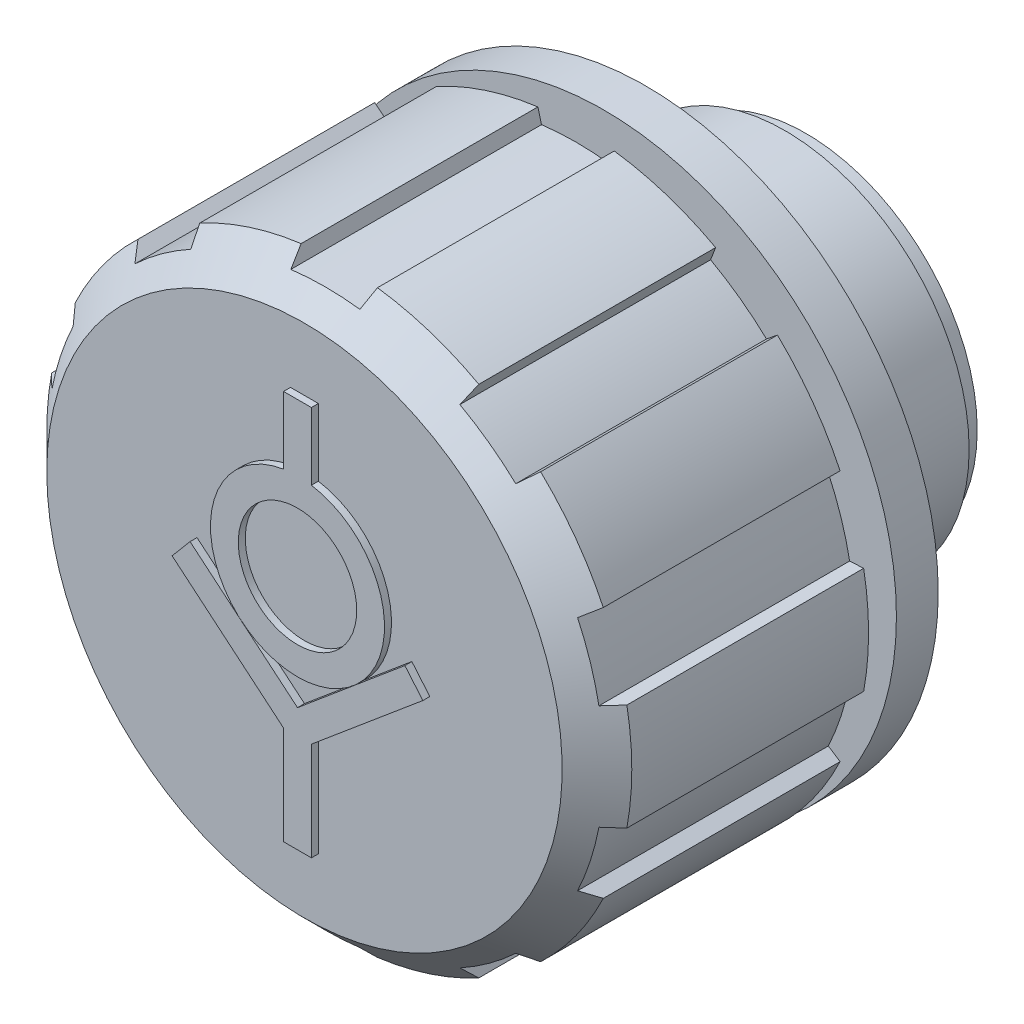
ISO-10303-21;
HEADER;
FILE_DESCRIPTION(('STEP AP214'),'2;1');
FILE_NAME('part.step','',(''),(''),'','','');
FILE_SCHEMA(('AUTOMOTIVE_DESIGN { 1 0 10303 214 1 1 1 1 }'));
ENDSEC;
DATA;
#1=APPLICATION_CONTEXT('core data for automotive mechanical design processes');
#2=APPLICATION_PROTOCOL_DEFINITION('international standard','automotive_design',2000,#1);
#3=PRODUCT_CONTEXT('',#1,'mechanical');
#4=PRODUCT('Part','Part','',(#3));
#5=PRODUCT_RELATED_PRODUCT_CATEGORY('part','',(#4));
#6=PRODUCT_DEFINITION_FORMATION('','',#4);
#7=PRODUCT_DEFINITION_CONTEXT('part definition',#1,'design');
#8=PRODUCT_DEFINITION('design','',#6,#7);
#9=PRODUCT_DEFINITION_SHAPE('','',#8);
#10=(LENGTH_UNIT() NAMED_UNIT(*) SI_UNIT(.MILLI.,.METRE.));
#11=(NAMED_UNIT(*) PLANE_ANGLE_UNIT() SI_UNIT($,.RADIAN.));
#12=(NAMED_UNIT(*) SI_UNIT($,.STERADIAN.) SOLID_ANGLE_UNIT());
#13=UNCERTAINTY_MEASURE_WITH_UNIT(LENGTH_MEASURE(1.E-05),#10,'distance_accuracy_value','');
#14=(GEOMETRIC_REPRESENTATION_CONTEXT(3) GLOBAL_UNCERTAINTY_ASSIGNED_CONTEXT((#13)) GLOBAL_UNIT_ASSIGNED_CONTEXT((#10,
#11,#12)) REPRESENTATION_CONTEXT('',''));
#15=CARTESIAN_POINT('',(0.,0.,0.));
#16=DIRECTION('',(0.,0.,1.));
#17=DIRECTION('',(1.,0.,0.));
#18=AXIS2_PLACEMENT_3D('',#15,#16,#17);
#19=CARTESIAN_POINT('',(0.,20.0454545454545,1.5));
#20=DIRECTION('',(0.,0.,-1.));
#21=DIRECTION('',(-1.,0.,0.));
#22=AXIS2_PLACEMENT_3D('',#19,#20,#21);
#23=PLANE('',#22);
#24=CARTESIAN_POINT('',(0.,0.,1.5));
#25=DIRECTION('',(0.,0.,1.));
#26=DIRECTION('',(1.,0.,0.));
#27=AXIS2_PLACEMENT_3D('',#24,#25,#26);
#28=CIRCLE('',#27,21.);
#29=CARTESIAN_POINT('',(21.,0.,1.5));
#30=VERTEX_POINT('',#29);
#31=EDGE_CURVE('E952',#30,#30,#28,.T.);
#32=ORIENTED_EDGE('',*,*,#31,.F.);
#33=EDGE_LOOP('',(#32));
#34=FACE_BOUND('',#33,.T.);
#35=CARTESIAN_POINT('',(0.,0.,1.5));
#36=DIRECTION('',(0.,0.,-1.));
#37=DIRECTION('',(0.,1.,0.));
#38=AXIS2_PLACEMENT_3D('',#35,#36,#37);
#39=CIRCLE('',#38,17.);
#40=CARTESIAN_POINT('',(0.,17.,1.49999999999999));
#41=VERTEX_POINT('',#40);
#42=EDGE_CURVE('E960',#41,#41,#39,.F.);
#43=ORIENTED_EDGE('',*,*,#42,.T.);
#44=EDGE_LOOP('',(#43));
#45=FACE_BOUND('',#44,.T.);
#46=ADVANCED_FACE('F14',(#34,#45),#23,.T.);
#47=CARTESIAN_POINT('',(0.,0.,3.));
#48=DIRECTION('',(0.,0.,1.));
#49=DIRECTION('',(1.,0.,0.));
#50=AXIS2_PLACEMENT_3D('',#47,#48,#49);
#51=CYLINDRICAL_SURFACE('',#50,21.);
#52=ORIENTED_EDGE('',*,*,#31,.T.);
#53=EDGE_LOOP('',(#52));
#54=FACE_BOUND('',#53,.T.);
#55=CARTESIAN_POINT('',(0.,0.,4.5));
#56=DIRECTION('',(0.,0.,1.));
#57=DIRECTION('',(1.,0.,0.));
#58=AXIS2_PLACEMENT_3D('',#55,#56,#57);
#59=CIRCLE('',#58,21.);
#60=CARTESIAN_POINT('',(21.,0.,4.5));
#61=VERTEX_POINT('',#60);
#62=EDGE_CURVE('E955',#61,#61,#59,.T.);
#63=ORIENTED_EDGE('',*,*,#62,.F.);
#64=EDGE_LOOP('',(#63));
#65=FACE_BOUND('',#64,.T.);
#66=ADVANCED_FACE('F990',(#54,#65),#51,.T.);
#67=CARTESIAN_POINT('',(0.,17.5,4.5));
#68=DIRECTION('',(0.,0.,1.));
#69=DIRECTION('',(1.,0.,0.));
#70=AXIS2_PLACEMENT_3D('',#67,#68,#69);
#71=PLANE('',#70);
#72=CARTESIAN_POINT('',(0.,0.,4.5));
#73=DIRECTION('',(0.,0.,1.));
#74=DIRECTION('',(1.,0.,0.));
#75=AXIS2_PLACEMENT_3D('',#72,#73,#74);
#76=CIRCLE('',#75,14.);
#77=CARTESIAN_POINT('',(14.,0.,4.5));
#78=VERTEX_POINT('',#77);
#79=EDGE_CURVE('E24',#78,#78,#76,.T.);
#80=ORIENTED_EDGE('',*,*,#79,.F.);
#81=EDGE_LOOP('',(#80));
#82=FACE_BOUND('',#81,.T.);
#83=ORIENTED_EDGE('',*,*,#62,.T.);
#84=EDGE_LOOP('',(#83));
#85=FACE_BOUND('',#84,.T.);
#86=ADVANCED_FACE('F1543',(#82,#85),#71,.T.);
#87=CARTESIAN_POINT('',(0.,0.,5.5));
#88=DIRECTION('',(0.,0.,1.));
#89=DIRECTION('',(1.,0.,0.));
#90=AXIS2_PLACEMENT_3D('',#87,#88,#89);
#91=CYLINDRICAL_SURFACE('',#90,14.);
#92=ORIENTED_EDGE('',*,*,#79,.T.);
#93=EDGE_LOOP('',(#92));
#94=FACE_BOUND('',#93,.T.);
#95=CARTESIAN_POINT('',(0.,0.,6.5));
#96=DIRECTION('',(0.,0.,1.));
#97=DIRECTION('',(1.,0.,0.));
#98=AXIS2_PLACEMENT_3D('',#95,#96,#97);
#99=CIRCLE('',#98,14.);
#100=CARTESIAN_POINT('',(14.,0.,6.5));
#101=VERTEX_POINT('',#100);
#102=EDGE_CURVE('E9',#101,#101,#99,.T.);
#103=ORIENTED_EDGE('',*,*,#102,.F.);
#104=EDGE_LOOP('',(#103));
#105=FACE_BOUND('',#104,.T.);
#106=ADVANCED_FACE('F1548',(#94,#105),#91,.T.);
#107=CARTESIAN_POINT('',(0.,15.4,6.5));
#108=DIRECTION('',(0.,0.,-1.));
#109=DIRECTION('',(-1.,0.,0.));
#110=AXIS2_PLACEMENT_3D('',#107,#108,#109);
#111=PLANE('',#110);
#112=ORIENTED_EDGE('',*,*,#102,.T.);
#113=EDGE_LOOP('',(#112));
#114=FACE_BOUND('',#113,.T.);
#115=CARTESIAN_POINT('',(0.,0.,6.5));
#116=DIRECTION('',(0.,0.,1.));
#117=DIRECTION('',(1.,0.,0.));
#118=AXIS2_PLACEMENT_3D('',#115,#116,#117);
#119=CIRCLE('',#118,21.);
#120=CARTESIAN_POINT('',(-20.648353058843,3.82694603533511,6.5));
#121=VERTEX_POINT('',#120);
#122=CARTESIAN_POINT('',(-20.648353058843,-3.82694603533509,6.5));
#123=VERTEX_POINT('',#122);
#124=EDGE_CURVE('E377',#121,#123,#119,.T.);
#125=ORIENTED_EDGE('',*,*,#124,.F.);
#126=DIRECTION('',(0.998629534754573,-0.0523359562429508,0.));
#127=VECTOR('',#126,1.);
#128=CARTESIAN_POINT('',(-20.648353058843,3.82694603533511,6.5));
#129=LINE('',#128,#127);
#130=CARTESIAN_POINT('',(-19.640669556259,3.77413558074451,6.5));
#131=VERTEX_POINT('',#130);
#132=EDGE_CURVE('E802',#121,#131,#129,.T.);
#133=ORIENTED_EDGE('',*,*,#132,.T.);
#134=CARTESIAN_POINT('',(2.00278519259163E-13,-1.02151947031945E-13,6.5));
#135=DIRECTION('',(0.,0.,1.));
#136=DIRECTION('',(1.,0.,0.));
#137=AXIS2_PLACEMENT_3D('',#134,#135,#136);
#138=CIRCLE('',#137,20.);
#139=CARTESIAN_POINT('',(-18.10801668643,8.49115608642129,6.5));
#140=VERTEX_POINT('',#139);
#141=EDGE_CURVE('E382',#140,#131,#138,.T.);
#142=ORIENTED_EDGE('',*,*,#141,.F.);
#143=DIRECTION('',(-0.838670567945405,0.544639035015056,0.));
#144=VECTOR('',#143,1.);
#145=CARTESIAN_POINT('',(-18.1080166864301,8.49115608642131,6.5));
#146=LINE('',#145,#144);
#147=CARTESIAN_POINT('',(-18.954290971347,9.04073303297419,6.5));
#148=VERTEX_POINT('',#147);
#149=EDGE_CURVE('E768',#140,#148,#146,.T.);
#150=ORIENTED_EDGE('',*,*,#149,.T.);
#151=CARTESIAN_POINT('',(-3.37957603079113E-13,3.33055478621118E-13,6.5));
#152=DIRECTION('',(0.,0.,1.));
#153=DIRECTION('',(1.,0.,0.));
#154=AXIS2_PLACEMENT_3D('',#151,#152,#153);
#155=CIRCLE('',#154,20.9999999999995);
#156=CARTESIAN_POINT('',(-14.4554460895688,15.232861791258,6.5));
#157=VERTEX_POINT('',#156);
#158=EDGE_CURVE('E387',#157,#148,#155,.T.);
#159=ORIENTED_EDGE('',*,*,#158,.F.);
#160=DIRECTION('',(0.777145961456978,-0.629320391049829,0.));
#161=VECTOR('',#160,1.);
#162=CARTESIAN_POINT('',(-14.4554460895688,15.232861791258,6.5));
#163=LINE('',#162,#161);
#164=CARTESIAN_POINT('',(-13.6712542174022,14.5978357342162,6.5));
#165=VERTEX_POINT('',#164);
#166=EDGE_CURVE('E770',#157,#165,#163,.T.);
#167=ORIENTED_EDGE('',*,*,#166,.T.);
#168=CARTESIAN_POINT('',(2.94425431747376E-13,-2.88669415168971E-13,6.5));
#169=DIRECTION('',(0.,0.,1.));
#170=DIRECTION('',(1.,0.,0.));
#171=AXIS2_PLACEMENT_3D('',#168,#169,#170);
#172=CIRCLE('',#171,20.0000000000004);
#173=CARTESIAN_POINT('',(-9.65871691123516,17.5131147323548,6.5));
#174=VERTEX_POINT('',#173);
#175=EDGE_CURVE('E392',#174,#165,#172,.T.);
#176=ORIENTED_EDGE('',*,*,#175,.F.);
#177=DIRECTION('',(-0.358367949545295,0.933580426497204,0.));
#178=VECTOR('',#177,1.);
#179=CARTESIAN_POINT('',(-9.65871691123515,17.5131147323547,6.5));
#180=LINE('',#179,#178);
#181=CARTESIAN_POINT('',(-10.0203339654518,18.4551593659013,6.5));
#182=VERTEX_POINT('',#181);
#183=EDGE_CURVE('E772',#174,#182,#180,.T.);
#184=ORIENTED_EDGE('',*,*,#183,.T.);
#185=CARTESIAN_POINT('',(0.,0.,6.5));
#186=DIRECTION('',(0.,0.,1.));
#187=DIRECTION('',(1.,0.,0.));
#188=AXIS2_PLACEMENT_3D('',#185,#186,#187);
#189=CIRCLE('',#188,21.);
#190=CARTESIAN_POINT('',(-2.74105003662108,20.82034208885,6.5));
#191=VERTEX_POINT('',#190);
#192=EDGE_CURVE('E397',#191,#182,#189,.T.);
#193=ORIENTED_EDGE('',*,*,#192,.F.);
#194=DIRECTION('',(0.258819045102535,-0.965925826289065,0.));
#195=VECTOR('',#194,1.);
#196=CARTESIAN_POINT('',(-2.74105003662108,20.82034208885,6.5));
#197=LINE('',#196,#195);
#198=CARTESIAN_POINT('',(-2.47988443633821,19.8456587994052,6.5));
#199=VERTEX_POINT('',#198);
#200=EDGE_CURVE('E774',#191,#199,#197,.T.);
#201=ORIENTED_EDGE('',*,*,#200,.T.);
#202=CARTESIAN_POINT('',(0.,3.79240756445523E-13,6.5));
#203=DIRECTION('',(0.,0.,1.));
#204=DIRECTION('',(1.,0.,0.));
#205=AXIS2_PLACEMENT_3D('',#202,#203,#204);
#206=CIRCLE('',#205,19.9999999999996);
#207=CARTESIAN_POINT('',(2.4798844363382,19.8456587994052,6.5));
#208=VERTEX_POINT('',#207);
#209=EDGE_CURVE('E402',#208,#199,#206,.T.);
#210=ORIENTED_EDGE('',*,*,#209,.F.);
#211=DIRECTION('',(0.258819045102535,0.965925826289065,0.));
#212=VECTOR('',#211,1.);
#213=CARTESIAN_POINT('',(2.47988443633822,19.8456587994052,6.5));
#214=LINE('',#213,#212);
#215=CARTESIAN_POINT('',(2.74105003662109,20.82034208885,6.5));
#216=VERTEX_POINT('',#215);
#217=EDGE_CURVE('E776',#208,#216,#214,.T.);
#218=ORIENTED_EDGE('',*,*,#217,.T.);
#219=CARTESIAN_POINT('',(-1.30123852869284E-13,-4.59199671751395E-13,6.5));
#220=DIRECTION('',(0.,0.,1.));
#221=DIRECTION('',(1.,0.,0.));
#222=AXIS2_PLACEMENT_3D('',#219,#220,#221);
#223=CIRCLE('',#222,21.0000000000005);
#224=CARTESIAN_POINT('',(10.0203339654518,18.4551593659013,6.5));
#225=VERTEX_POINT('',#224);
#226=EDGE_CURVE('E407',#225,#216,#223,.T.);
#227=ORIENTED_EDGE('',*,*,#226,.F.);
#228=DIRECTION('',(-0.358367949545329,-0.933580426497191,0.));
#229=VECTOR('',#228,1.);
#230=CARTESIAN_POINT('',(10.0203339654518,18.4551593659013,6.5));
#231=LINE('',#230,#229);
#232=CARTESIAN_POINT('',(9.65871691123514,17.5131147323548,6.5));
#233=VERTEX_POINT('',#232);
#234=EDGE_CURVE('E778',#225,#233,#231,.T.);
#235=ORIENTED_EDGE('',*,*,#234,.T.);
#236=CARTESIAN_POINT('',(0.,2.54895777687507E-13,6.5));
#237=DIRECTION('',(0.,0.,1.));
#238=DIRECTION('',(1.,0.,0.));
#239=AXIS2_PLACEMENT_3D('',#236,#237,#238);
#240=CIRCLE('',#239,20.);
#241=CARTESIAN_POINT('',(13.6712542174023,14.5978357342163,6.5));
#242=VERTEX_POINT('',#241);
#243=EDGE_CURVE('E412',#242,#233,#240,.T.);
#244=ORIENTED_EDGE('',*,*,#243,.F.);
#245=DIRECTION('',(0.777145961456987,0.629320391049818,0.));
#246=VECTOR('',#245,1.);
#247=CARTESIAN_POINT('',(13.6712542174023,14.5978357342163,6.5));
#248=LINE('',#247,#246);
#249=CARTESIAN_POINT('',(14.4554460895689,15.232861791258,6.5));
#250=VERTEX_POINT('',#249);
#251=EDGE_CURVE('E780',#242,#250,#248,.T.);
#252=ORIENTED_EDGE('',*,*,#251,.T.);
#253=CARTESIAN_POINT('',(0.,0.,6.5));
#254=DIRECTION('',(0.,0.,1.));
#255=DIRECTION('',(1.,0.,0.));
#256=AXIS2_PLACEMENT_3D('',#253,#254,#255);
#257=CIRCLE('',#256,21.);
#258=CARTESIAN_POINT('',(18.9542909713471,9.0407330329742,6.5));
#259=VERTEX_POINT('',#258);
#260=EDGE_CURVE('E417',#259,#250,#257,.T.);
#261=ORIENTED_EDGE('',*,*,#260,.F.);
#262=DIRECTION('',(-0.838670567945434,-0.544639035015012,0.));
#263=VECTOR('',#262,1.);
#264=CARTESIAN_POINT('',(18.9542909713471,9.04073303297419,6.5));
#265=LINE('',#264,#263);
#266=CARTESIAN_POINT('',(18.1080166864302,8.49115608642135,6.5));
#267=VERTEX_POINT('',#266);
#268=EDGE_CURVE('E782',#259,#267,#265,.T.);
#269=ORIENTED_EDGE('',*,*,#268,.T.);
#270=CARTESIAN_POINT('',(-3.68155669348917E-13,0.,6.5));
#271=DIRECTION('',(0.,0.,1.));
#272=DIRECTION('',(1.,0.,0.));
#273=AXIS2_PLACEMENT_3D('',#270,#271,#272);
#274=CIRCLE('',#273,20.0000000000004);
#275=CARTESIAN_POINT('',(19.640669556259,3.77413558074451,6.5));
#276=VERTEX_POINT('',#275);
#277=EDGE_CURVE('E422',#276,#267,#274,.T.);
#278=ORIENTED_EDGE('',*,*,#277,.F.);
#279=DIRECTION('',(0.998629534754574,0.0523359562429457,0.));
#280=VECTOR('',#279,1.);
#281=CARTESIAN_POINT('',(19.640669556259,3.77413558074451,6.5));
#282=LINE('',#281,#280);
#283=CARTESIAN_POINT('',(20.648353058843,3.82694603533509,6.5));
#284=VERTEX_POINT('',#283);
#285=EDGE_CURVE('E784',#276,#284,#282,.T.);
#286=ORIENTED_EDGE('',*,*,#285,.T.);
#287=CARTESIAN_POINT('',(0.,0.,6.5));
#288=DIRECTION('',(0.,0.,1.));
#289=DIRECTION('',(1.,0.,0.));
#290=AXIS2_PLACEMENT_3D('',#287,#288,#289);
#291=CIRCLE('',#290,21.);
#292=CARTESIAN_POINT('',(20.648353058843,-3.82694603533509,6.5));
#293=VERTEX_POINT('',#292);
#294=EDGE_CURVE('E427',#293,#284,#291,.T.);
#295=ORIENTED_EDGE('',*,*,#294,.F.);
#296=DIRECTION('',(-0.998629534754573,0.0523359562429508,0.));
#297=VECTOR('',#296,1.);
#298=CARTESIAN_POINT('',(20.648353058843,-3.8269460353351,6.5));
#299=LINE('',#298,#297);
#300=CARTESIAN_POINT('',(19.640669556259,-3.77413558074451,6.5));
#301=VERTEX_POINT('',#300);
#302=EDGE_CURVE('E786',#293,#301,#299,.T.);
#303=ORIENTED_EDGE('',*,*,#302,.T.);
#304=CARTESIAN_POINT('',(0.,0.,6.5));
#305=DIRECTION('',(0.,0.,1.));
#306=DIRECTION('',(1.,0.,0.));
#307=AXIS2_PLACEMENT_3D('',#304,#305,#306);
#308=CIRCLE('',#307,20.);
#309=CARTESIAN_POINT('',(18.1080166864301,-8.4911560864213,6.5));
#310=VERTEX_POINT('',#309);
#311=EDGE_CURVE('E432',#310,#301,#308,.T.);
#312=ORIENTED_EDGE('',*,*,#311,.F.);
#313=DIRECTION('',(0.838670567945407,-0.544639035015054,0.));
#314=VECTOR('',#313,1.);
#315=CARTESIAN_POINT('',(18.1080166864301,-8.49115608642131,6.5));
#316=LINE('',#315,#314);
#317=CARTESIAN_POINT('',(18.954290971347,-9.0407330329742,6.5));
#318=VERTEX_POINT('',#317);
#319=EDGE_CURVE('E788',#310,#318,#316,.T.);
#320=ORIENTED_EDGE('',*,*,#319,.T.);
#321=CARTESIAN_POINT('',(2.67780079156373E-13,-2.95774842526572E-13,6.5));
#322=DIRECTION('',(0.,0.,1.));
#323=DIRECTION('',(1.,0.,0.));
#324=AXIS2_PLACEMENT_3D('',#321,#322,#323);
#325=CIRCLE('',#324,20.9999999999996);
#326=CARTESIAN_POINT('',(14.4554460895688,-15.232861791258,6.5));
#327=VERTEX_POINT('',#326);
#328=EDGE_CURVE('E437',#327,#318,#325,.T.);
#329=ORIENTED_EDGE('',*,*,#328,.F.);
#330=DIRECTION('',(-0.777145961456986,0.629320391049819,0.));
#331=VECTOR('',#330,1.);
#332=CARTESIAN_POINT('',(14.4554460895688,-15.232861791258,6.5));
#333=LINE('',#332,#331);
#334=CARTESIAN_POINT('',(13.6712542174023,-14.5978357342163,6.5));
#335=VERTEX_POINT('',#334);
#336=EDGE_CURVE('E657',#327,#335,#333,.T.);
#337=ORIENTED_EDGE('',*,*,#336,.T.);
#338=CARTESIAN_POINT('',(1.68304096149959E-13,-1.67877150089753E-13,6.5));
#339=DIRECTION('',(0.,0.,1.));
#340=DIRECTION('',(1.,0.,0.));
#341=AXIS2_PLACEMENT_3D('',#338,#339,#340);
#342=CIRCLE('',#341,20.);
#343=CARTESIAN_POINT('',(9.65871691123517,-17.5131147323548,6.5));
#344=VERTEX_POINT('',#343);
#345=EDGE_CURVE('E317',#344,#335,#342,.T.);
#346=ORIENTED_EDGE('',*,*,#345,.F.);
#347=DIRECTION('',(0.358367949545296,-0.933580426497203,0.));
#348=VECTOR('',#347,1.);
#349=CARTESIAN_POINT('',(9.65871691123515,-17.5131147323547,6.5));
#350=LINE('',#349,#348);
#351=CARTESIAN_POINT('',(10.0203339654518,-18.4551593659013,6.5));
#352=VERTEX_POINT('',#351);
#353=EDGE_CURVE('E313',#344,#352,#350,.T.);
#354=ORIENTED_EDGE('',*,*,#353,.T.);
#355=CARTESIAN_POINT('',(1.51872795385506E-13,0.,6.5));
#356=DIRECTION('',(0.,0.,1.));
#357=DIRECTION('',(1.,0.,0.));
#358=AXIS2_PLACEMENT_3D('',#355,#356,#357);
#359=CIRCLE('',#358,21.);
#360=CARTESIAN_POINT('',(2.74105003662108,-20.82034208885,6.5));
#361=VERTEX_POINT('',#360);
#362=EDGE_CURVE('E336',#361,#352,#359,.T.);
#363=ORIENTED_EDGE('',*,*,#362,.F.);
#364=DIRECTION('',(-0.258819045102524,0.965925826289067,0.));
#365=VECTOR('',#364,1.);
#366=CARTESIAN_POINT('',(2.74105003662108,-20.82034208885,6.5));
#367=LINE('',#366,#365);
#368=CARTESIAN_POINT('',(2.47988443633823,-19.8456587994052,6.5));
#369=VERTEX_POINT('',#368);
#370=EDGE_CURVE('E455',#361,#369,#367,.T.);
#371=ORIENTED_EDGE('',*,*,#370,.T.);
#372=CARTESIAN_POINT('',(0.,-1.46560868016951E-13,6.5));
#373=DIRECTION('',(0.,0.,1.));
#374=DIRECTION('',(1.,0.,0.));
#375=AXIS2_PLACEMENT_3D('',#372,#373,#374);
#376=CIRCLE('',#375,20.);
#377=CARTESIAN_POINT('',(-2.47988443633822,-19.8456587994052,6.5));
#378=VERTEX_POINT('',#377);
#379=EDGE_CURVE('E352',#378,#369,#376,.T.);
#380=ORIENTED_EDGE('',*,*,#379,.F.);
#381=DIRECTION('',(-0.258819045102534,-0.965925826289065,0.));
#382=VECTOR('',#381,1.);
#383=CARTESIAN_POINT('',(-2.47988443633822,-19.8456587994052,6.5));
#384=LINE('',#383,#382);
#385=CARTESIAN_POINT('',(-2.74105003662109,-20.82034208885,6.5));
#386=VERTEX_POINT('',#385);
#387=EDGE_CURVE('E792',#378,#386,#384,.T.);
#388=ORIENTED_EDGE('',*,*,#387,.T.);
#389=CARTESIAN_POINT('',(0.,2.122632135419E-13,6.5));
#390=DIRECTION('',(0.,0.,1.));
#391=DIRECTION('',(1.,0.,0.));
#392=AXIS2_PLACEMENT_3D('',#389,#390,#391);
#393=CIRCLE('',#392,21.);
#394=CARTESIAN_POINT('',(-10.0203339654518,-18.4551593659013,6.5));
#395=VERTEX_POINT('',#394);
#396=EDGE_CURVE('E357',#395,#386,#393,.T.);
#397=ORIENTED_EDGE('',*,*,#396,.F.);
#398=DIRECTION('',(0.358367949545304,0.9335804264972,0.));
#399=VECTOR('',#398,1.);
#400=CARTESIAN_POINT('',(-10.0203339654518,-18.4551593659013,6.5));
#401=LINE('',#400,#399);
#402=CARTESIAN_POINT('',(-9.65871691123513,-17.5131147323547,6.5));
#403=VERTEX_POINT('',#402);
#404=EDGE_CURVE('E794',#395,#403,#401,.T.);
#405=ORIENTED_EDGE('',*,*,#404,.T.);
#406=CARTESIAN_POINT('',(1.68304096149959E-13,4.2187332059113E-13,6.5));
#407=DIRECTION('',(0.,0.,1.));
#408=DIRECTION('',(1.,0.,0.));
#409=AXIS2_PLACEMENT_3D('',#406,#407,#408);
#410=CIRCLE('',#409,20.0000000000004);
#411=CARTESIAN_POINT('',(-13.6712542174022,-14.5978357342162,6.5));
#412=VERTEX_POINT('',#411);
#413=EDGE_CURVE('E362',#412,#403,#410,.T.);
#414=ORIENTED_EDGE('',*,*,#413,.F.);
#415=DIRECTION('',(-0.777145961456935,-0.629320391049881,0.));
#416=VECTOR('',#415,1.);
#417=CARTESIAN_POINT('',(-13.6712542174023,-14.5978357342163,6.5));
#418=LINE('',#417,#416);
#419=CARTESIAN_POINT('',(-14.4554460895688,-15.2328617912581,6.5));
#420=VERTEX_POINT('',#419);
#421=EDGE_CURVE('E796',#412,#420,#418,.T.);
#422=ORIENTED_EDGE('',*,*,#421,.T.);
#423=CARTESIAN_POINT('',(0.,0.,6.5));
#424=DIRECTION('',(0.,0.,1.));
#425=DIRECTION('',(1.,0.,0.));
#426=AXIS2_PLACEMENT_3D('',#423,#424,#425);
#427=CIRCLE('',#426,21.);
#428=CARTESIAN_POINT('',(-18.9542909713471,-9.04073303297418,6.5));
#429=VERTEX_POINT('',#428);
#430=EDGE_CURVE('E367',#429,#420,#427,.T.);
#431=ORIENTED_EDGE('',*,*,#430,.F.);
#432=DIRECTION('',(0.838670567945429,0.54463903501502,0.));
#433=VECTOR('',#432,1.);
#434=CARTESIAN_POINT('',(-18.9542909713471,-9.04073303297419,6.5));
#435=LINE('',#434,#433);
#436=CARTESIAN_POINT('',(-18.1080166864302,-8.49115608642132,6.5));
#437=VERTEX_POINT('',#436);
#438=EDGE_CURVE('E798',#429,#437,#435,.T.);
#439=ORIENTED_EDGE('',*,*,#438,.T.);
#440=CARTESIAN_POINT('',(-2.04730840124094E-13,-1.31017745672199E-13,6.5));
#441=DIRECTION('',(0.,0.,1.));
#442=DIRECTION('',(1.,0.,0.));
#443=AXIS2_PLACEMENT_3D('',#440,#441,#442);
#444=CIRCLE('',#443,20.);
#445=CARTESIAN_POINT('',(-19.640669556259,-3.77413558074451,6.5));
#446=VERTEX_POINT('',#445);
#447=EDGE_CURVE('E372',#446,#437,#444,.T.);
#448=ORIENTED_EDGE('',*,*,#447,.F.);
#449=DIRECTION('',(-0.998629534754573,-0.0523359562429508,0.));
#450=VECTOR('',#449,1.);
#451=CARTESIAN_POINT('',(-19.640669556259,-3.77413558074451,6.5));
#452=LINE('',#451,#450);
#453=EDGE_CURVE('E800',#446,#123,#452,.T.);
#454=ORIENTED_EDGE('',*,*,#453,.T.);
#455=EDGE_LOOP('',(#125,#133,#142,#150,#159,#167,#176,#184,#193,#201,#210,#218,#227,#235,#244,
#252,#261,#269,#278,#286,#295,#303,#312,#320,#329,#337,#346,#354,#363,#371,#380,#388,#397,#405,
#414,#422,#431,#439,#448,#454));
#456=FACE_BOUND('',#455,.T.);
#457=ADVANCED_FACE('F1232',(#114,#456),#111,.T.);
#458=CARTESIAN_POINT('',(0.,0.,26.));
#459=DIRECTION('',(0.,0.,1.));
#460=DIRECTION('',(1.,0.,0.));
#461=AXIS2_PLACEMENT_3D('',#458,#459,#460);
#462=PLANE('',#461);
#463=CARTESIAN_POINT('',(0.,3.,26.));
#464=DIRECTION('',(0.,0.,1.));
#465=DIRECTION('',(1.,0.,0.));
#466=AXIS2_PLACEMENT_3D('',#463,#464,#465);
#467=CIRCLE('',#466,4.25);
#468=CARTESIAN_POINT('',(4.25000000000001,3.,26.));
#469=VERTEX_POINT('',#468);
#470=EDGE_CURVE('E18',#469,#469,#467,.T.);
#471=ORIENTED_EDGE('',*,*,#470,.T.);
#472=EDGE_LOOP('',(#471));
#473=FACE_BOUND('',#472,.T.);
#474=ADVANCED_FACE('F16',(#473),#462,.T.);
#475=CARTESIAN_POINT('',(0.,3.,27.));
#476=DIRECTION('',(0.,0.,1.));
#477=DIRECTION('',(1.,0.,0.));
#478=AXIS2_PLACEMENT_3D('',#475,#476,#477);
#479=CYLINDRICAL_SURFACE('',#478,4.25);
#480=ORIENTED_EDGE('',*,*,#470,.F.);
#481=EDGE_LOOP('',(#480));
#482=FACE_BOUND('',#481,.T.);
#483=CARTESIAN_POINT('',(0.,3.,26.5));
#484=DIRECTION('',(0.,0.,1.));
#485=DIRECTION('',(1.,0.,0.));
#486=AXIS2_PLACEMENT_3D('',#483,#484,#485);
#487=CIRCLE('',#486,4.25);
#488=CARTESIAN_POINT('',(4.25000000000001,3.,26.5));
#489=VERTEX_POINT('',#488);
#490=EDGE_CURVE('E337',#489,#489,#487,.F.);
#491=ORIENTED_EDGE('',*,*,#490,.F.);
#492=EDGE_LOOP('',(#491));
#493=FACE_BOUND('',#492,.T.);
#494=ADVANCED_FACE('F1174',(#482,#493),#479,.F.);
#495=CARTESIAN_POINT('',(0.,0.,26.5));
#496=DIRECTION('',(0.,0.,1.));
#497=DIRECTION('',(1.,0.,0.));
#498=AXIS2_PLACEMENT_3D('',#495,#496,#497);
#499=PLANE('',#498);
#500=DIRECTION('',(-0.766342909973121,0.642431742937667,0.));
#501=VECTOR('',#500,1.);
#502=CARTESIAN_POINT('',(0.,-5.16,26.5));
#503=LINE('',#502,#501);
#504=CARTESIAN_POINT('',(-7.71328094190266,1.3061086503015,26.5));
#505=VERTEX_POINT('',#504);
#506=CARTESIAN_POINT('',(0.,-5.16,26.5));
#507=VERTEX_POINT('',#506);
#508=EDGE_CURVE('E851',#505,#507,#503,.F.);
#509=ORIENTED_EDGE('',*,*,#508,.F.);
#510=DIRECTION('',(-0.644597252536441,-0.764522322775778,0.));
#511=VECTOR('',#510,1.);
#512=CARTESIAN_POINT('',(-7.71328094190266,1.3061086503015,26.5));
#513=LINE('',#512,#511);
#514=CARTESIAN_POINT('',(-9.,-0.219999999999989,26.5));
#515=VERTEX_POINT('',#514);
#516=EDGE_CURVE('E845',#515,#505,#513,.F.);
#517=ORIENTED_EDGE('',*,*,#516,.F.);
#518=DIRECTION('',(0.766176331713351,-0.642630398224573,0.));
#519=VECTOR('',#518,1.);
#520=CARTESIAN_POINT('',(-9.,-0.219999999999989,26.5));
#521=LINE('',#520,#519);
#522=CARTESIAN_POINT('',(-1.,-6.93,26.5));
#523=VERTEX_POINT('',#522);
#524=EDGE_CURVE('E839',#523,#515,#521,.F.);
#525=ORIENTED_EDGE('',*,*,#524,.F.);
#526=DIRECTION('',(0.,1.,0.));
#527=VECTOR('',#526,1.);
#528=CARTESIAN_POINT('',(-1.,-6.93,26.5));
#529=LINE('',#528,#527);
#530=CARTESIAN_POINT('',(-1.,-14.,26.5));
#531=VERTEX_POINT('',#530);
#532=EDGE_CURVE('E822',#531,#523,#529,.T.);
#533=ORIENTED_EDGE('',*,*,#532,.F.);
#534=DIRECTION('',(1.,0.,0.));
#535=VECTOR('',#534,1.);
#536=CARTESIAN_POINT('',(-1.,-14.,26.5));
#537=LINE('',#536,#535);
#538=CARTESIAN_POINT('',(1.,-14.,26.5));
#539=VERTEX_POINT('',#538);
#540=EDGE_CURVE('E881',#539,#531,#537,.F.);
#541=ORIENTED_EDGE('',*,*,#540,.F.);
#542=DIRECTION('',(0.,1.,0.));
#543=VECTOR('',#542,1.);
#544=CARTESIAN_POINT('',(1.,-14.,26.5));
#545=LINE('',#544,#543);
#546=CARTESIAN_POINT('',(1.,-6.93,26.5));
#547=VERTEX_POINT('',#546);
#548=EDGE_CURVE('E875',#547,#539,#545,.F.);
#549=ORIENTED_EDGE('',*,*,#548,.F.);
#550=DIRECTION('',(0.766176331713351,0.642630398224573,0.));
#551=VECTOR('',#550,1.);
#552=CARTESIAN_POINT('',(1.,-6.93,26.5));
#553=LINE('',#552,#551);
#554=CARTESIAN_POINT('',(9.,-0.21999999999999,26.5));
#555=VERTEX_POINT('',#554);
#556=EDGE_CURVE('E869',#555,#547,#553,.F.);
#557=ORIENTED_EDGE('',*,*,#556,.F.);
#558=DIRECTION('',(-0.644597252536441,0.764522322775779,0.));
#559=VECTOR('',#558,1.);
#560=CARTESIAN_POINT('',(9.,-0.21999999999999,26.5));
#561=LINE('',#560,#559);
#562=CARTESIAN_POINT('',(7.71,1.31,26.5));
#563=VERTEX_POINT('',#562);
#564=EDGE_CURVE('E863',#563,#555,#561,.F.);
#565=ORIENTED_EDGE('',*,*,#564,.F.);
#566=DIRECTION('',(-0.766017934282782,-0.64281920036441,0.));
#567=VECTOR('',#566,1.);
#568=CARTESIAN_POINT('',(7.71,1.31,26.5));
#569=LINE('',#568,#567);
#570=EDGE_CURVE('E857',#507,#563,#569,.F.);
#571=ORIENTED_EDGE('',*,*,#570,.F.);
#572=EDGE_LOOP('',(#509,#517,#525,#533,#541,#549,#557,#565,#571));
#573=FACE_BOUND('',#572,.T.);
#574=ADVANCED_FACE('F1060',(#573),#499,.T.);
#575=CARTESIAN_POINT('',(0.,0.,26.5));
#576=DIRECTION('',(0.,0.,1.));
#577=DIRECTION('',(1.,0.,0.));
#578=AXIS2_PLACEMENT_3D('',#575,#576,#577);
#579=PLANE('',#578);
#580=DIRECTION('',(-1.,0.,0.));
#581=VECTOR('',#580,1.);
#582=CARTESIAN_POINT('',(1.,14.,26.5));
#583=LINE('',#582,#581);
#584=CARTESIAN_POINT('',(-1.,14.,26.5));
#585=VERTEX_POINT('',#584);
#586=CARTESIAN_POINT('',(1.,14.,26.5));
#587=VERTEX_POINT('',#586);
#588=EDGE_CURVE('E811',#585,#587,#583,.F.);
#589=ORIENTED_EDGE('',*,*,#588,.F.);
#590=DIRECTION('',(0.,1.,0.));
#591=VECTOR('',#590,1.);
#592=CARTESIAN_POINT('',(-1.,14.,26.5));
#593=LINE('',#592,#591);
#594=CARTESIAN_POINT('',(-1.,9.16745522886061,26.5));
#595=VERTEX_POINT('',#594);
#596=EDGE_CURVE('E807',#595,#585,#593,.T.);
#597=ORIENTED_EDGE('',*,*,#596,.F.);
#598=CARTESIAN_POINT('',(0.,3.,26.5));
#599=DIRECTION('',(0.,0.,1.));
#600=DIRECTION('',(1.,0.,0.));
#601=AXIS2_PLACEMENT_3D('',#598,#599,#600);
#602=CIRCLE('',#601,6.248);
#603=CARTESIAN_POINT('',(1.,9.16745522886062,26.5));
#604=VERTEX_POINT('',#603);
#605=EDGE_CURVE('E348',#604,#595,#602,.F.);
#606=ORIENTED_EDGE('',*,*,#605,.F.);
#607=DIRECTION('',(0.,1.,0.));
#608=VECTOR('',#607,1.);
#609=CARTESIAN_POINT('',(1.,9.16745522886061,26.5));
#610=LINE('',#609,#608);
#611=EDGE_CURVE('E816',#587,#604,#610,.F.);
#612=ORIENTED_EDGE('',*,*,#611,.F.);
#613=EDGE_LOOP('',(#589,#597,#606,#612));
#614=FACE_BOUND('',#613,.T.);
#615=ORIENTED_EDGE('',*,*,#490,.T.);
#616=EDGE_LOOP('',(#615));
#617=FACE_BOUND('',#616,.T.);
#618=ADVANCED_FACE('F1170',(#614,#617),#579,.T.);
#619=CARTESIAN_POINT('',(1.,-6.93,26.5));
#620=DIRECTION('',(0.642630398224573,-0.766176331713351,0.));
#621=DIRECTION('',(0.766176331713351,0.642630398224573,0.));
#622=AXIS2_PLACEMENT_3D('',#619,#620,#621);
#623=PLANE('',#622);
#624=ORIENTED_EDGE('',*,*,#556,.T.);
#625=DIRECTION('',(0.,0.,-1.));
#626=VECTOR('',#625,1.);
#627=CARTESIAN_POINT('',(1.,-6.93,26.5));
#628=LINE('',#627,#626);
#629=CARTESIAN_POINT('',(1.,-6.93,26.));
#630=VERTEX_POINT('',#629);
#631=EDGE_CURVE('E872',#630,#547,#628,.F.);
#632=ORIENTED_EDGE('',*,*,#631,.F.);
#633=DIRECTION('',(-0.766176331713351,-0.642630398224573,0.));
#634=VECTOR('',#633,1.);
#635=CARTESIAN_POINT('',(9.,-0.219999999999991,26.));
#636=LINE('',#635,#634);
#637=CARTESIAN_POINT('',(9.,-0.21999999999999,26.));
#638=VERTEX_POINT('',#637);
#639=EDGE_CURVE('E918',#638,#630,#636,.T.);
#640=ORIENTED_EDGE('',*,*,#639,.F.);
#641=DIRECTION('',(0.,0.,1.));
#642=VECTOR('',#641,1.);
#643=CARTESIAN_POINT('',(9.,-0.219999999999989,26.5));
#644=LINE('',#643,#642);
#645=EDGE_CURVE('E866',#638,#555,#644,.T.);
#646=ORIENTED_EDGE('',*,*,#645,.T.);
#647=EDGE_LOOP('',(#624,#632,#640,#646));
#648=FACE_BOUND('',#647,.T.);
#649=ADVANCED_FACE('F1070',(#648),#623,.T.);
#650=CARTESIAN_POINT('',(9.,-0.21999999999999,26.5));
#651=DIRECTION('',(0.764522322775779,0.644597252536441,0.));
#652=DIRECTION('',(-0.644597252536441,0.764522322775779,0.));
#653=AXIS2_PLACEMENT_3D('',#650,#651,#652);
#654=PLANE('',#653);
#655=ORIENTED_EDGE('',*,*,#564,.T.);
#656=ORIENTED_EDGE('',*,*,#645,.F.);
#657=DIRECTION('',(0.644597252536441,-0.764522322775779,0.));
#658=VECTOR('',#657,1.);
#659=CARTESIAN_POINT('',(7.71,1.31,26.));
#660=LINE('',#659,#658);
#661=CARTESIAN_POINT('',(7.71,1.31,26.));
#662=VERTEX_POINT('',#661);
#663=EDGE_CURVE('E915',#662,#638,#660,.T.);
#664=ORIENTED_EDGE('',*,*,#663,.F.);
#665=DIRECTION('',(0.,0.,1.));
#666=VECTOR('',#665,1.);
#667=CARTESIAN_POINT('',(7.71,1.31000000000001,26.5));
#668=LINE('',#667,#666);
#669=EDGE_CURVE('E860',#662,#563,#668,.T.);
#670=ORIENTED_EDGE('',*,*,#669,.T.);
#671=EDGE_LOOP('',(#655,#656,#664,#670));
#672=FACE_BOUND('',#671,.T.);
#673=ADVANCED_FACE('F1073',(#672),#654,.T.);
#674=CARTESIAN_POINT('',(7.71,1.31,26.5));
#675=DIRECTION('',(-0.64281920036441,0.766017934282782,0.));
#676=DIRECTION('',(-0.766017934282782,-0.64281920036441,0.));
#677=AXIS2_PLACEMENT_3D('',#674,#675,#676);
#678=PLANE('',#677);
#679=ORIENTED_EDGE('',*,*,#570,.T.);
#680=ORIENTED_EDGE('',*,*,#669,.F.);
#681=DIRECTION('',(0.766017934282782,0.64281920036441,0.));
#682=VECTOR('',#681,1.);
#683=CARTESIAN_POINT('',(0.,-5.16,26.));
#684=LINE('',#683,#682);
#685=CARTESIAN_POINT('',(0.,-5.16,26.));
#686=VERTEX_POINT('',#685);
#687=EDGE_CURVE('E912',#686,#662,#684,.T.);
#688=ORIENTED_EDGE('',*,*,#687,.F.);
#689=DIRECTION('',(0.,0.,1.));
#690=VECTOR('',#689,1.);
#691=CARTESIAN_POINT('',(0.,-5.16,26.5));
#692=LINE('',#691,#690);
#693=EDGE_CURVE('E854',#686,#507,#692,.T.);
#694=ORIENTED_EDGE('',*,*,#693,.T.);
#695=EDGE_LOOP('',(#679,#680,#688,#694));
#696=FACE_BOUND('',#695,.T.);
#697=ADVANCED_FACE('F1076',(#696),#678,.T.);
#698=CARTESIAN_POINT('',(0.,-5.16,26.5));
#699=DIRECTION('',(0.642431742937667,0.766342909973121,0.));
#700=DIRECTION('',(-0.766342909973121,0.642431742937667,0.));
#701=AXIS2_PLACEMENT_3D('',#698,#699,#700);
#702=PLANE('',#701);
#703=ORIENTED_EDGE('',*,*,#508,.T.);
#704=ORIENTED_EDGE('',*,*,#693,.F.);
#705=DIRECTION('',(0.766342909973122,-0.642431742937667,0.));
#706=VECTOR('',#705,1.);
#707=CARTESIAN_POINT('',(-7.71328094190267,1.3061086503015,26.));
#708=LINE('',#707,#706);
#709=CARTESIAN_POINT('',(-7.71328094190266,1.3061086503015,26.));
#710=VERTEX_POINT('',#709);
#711=EDGE_CURVE('E909',#710,#686,#708,.T.);
#712=ORIENTED_EDGE('',*,*,#711,.F.);
#713=DIRECTION('',(0.,0.,1.));
#714=VECTOR('',#713,1.);
#715=CARTESIAN_POINT('',(-7.71328094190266,1.30610865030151,26.5));
#716=LINE('',#715,#714);
#717=EDGE_CURVE('E848',#710,#505,#716,.T.);
#718=ORIENTED_EDGE('',*,*,#717,.T.);
#719=EDGE_LOOP('',(#703,#704,#712,#718));
#720=FACE_BOUND('',#719,.T.);
#721=ADVANCED_FACE('F1079',(#720),#702,.T.);
#722=CARTESIAN_POINT('',(-7.71328094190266,1.3061086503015,26.5));
#723=DIRECTION('',(-0.764522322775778,0.644597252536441,0.));
#724=DIRECTION('',(-0.644597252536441,-0.764522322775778,0.));
#725=AXIS2_PLACEMENT_3D('',#722,#723,#724);
#726=PLANE('',#725);
#727=ORIENTED_EDGE('',*,*,#516,.T.);
#728=ORIENTED_EDGE('',*,*,#717,.F.);
#729=DIRECTION('',(0.64459725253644,0.76452232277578,0.));
#730=VECTOR('',#729,1.);
#731=CARTESIAN_POINT('',(-9.,-0.219999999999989,26.));
#732=LINE('',#731,#730);
#733=CARTESIAN_POINT('',(-9.,-0.219999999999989,26.));
#734=VERTEX_POINT('',#733);
#735=EDGE_CURVE('E906',#734,#710,#732,.T.);
#736=ORIENTED_EDGE('',*,*,#735,.F.);
#737=DIRECTION('',(0.,0.,1.));
#738=VECTOR('',#737,1.);
#739=CARTESIAN_POINT('',(-9.,-0.219999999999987,26.5));
#740=LINE('',#739,#738);
#741=EDGE_CURVE('E842',#734,#515,#740,.T.);
#742=ORIENTED_EDGE('',*,*,#741,.T.);
#743=EDGE_LOOP('',(#727,#728,#736,#742));
#744=FACE_BOUND('',#743,.T.);
#745=ADVANCED_FACE('F1081',(#744),#726,.T.);
#746=CARTESIAN_POINT('',(-9.,-0.219999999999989,26.5));
#747=DIRECTION('',(-0.642630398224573,-0.766176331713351,0.));
#748=DIRECTION('',(0.766176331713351,-0.642630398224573,0.));
#749=AXIS2_PLACEMENT_3D('',#746,#747,#748);
#750=PLANE('',#749);
#751=ORIENTED_EDGE('',*,*,#524,.T.);
#752=ORIENTED_EDGE('',*,*,#741,.F.);
#753=DIRECTION('',(-0.766176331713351,0.642630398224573,0.));
#754=VECTOR('',#753,1.);
#755=CARTESIAN_POINT('',(-1.,-6.93,26.));
#756=LINE('',#755,#754);
#757=CARTESIAN_POINT('',(-1.,-6.93,26.));
#758=VERTEX_POINT('',#757);
#759=EDGE_CURVE('E903',#758,#734,#756,.T.);
#760=ORIENTED_EDGE('',*,*,#759,.F.);
#761=DIRECTION('',(0.,0.,1.));
#762=VECTOR('',#761,1.);
#763=CARTESIAN_POINT('',(-1.,-6.93,26.5));
#764=LINE('',#763,#762);
#765=EDGE_CURVE('E836',#758,#523,#764,.T.);
#766=ORIENTED_EDGE('',*,*,#765,.T.);
#767=EDGE_LOOP('',(#751,#752,#760,#766));
#768=FACE_BOUND('',#767,.T.);
#769=ADVANCED_FACE('F1062',(#768),#750,.T.);
#770=CARTESIAN_POINT('',(-1.,-6.93,26.5));
#771=DIRECTION('',(-1.,0.,0.));
#772=DIRECTION('',(0.,0.,1.));
#773=AXIS2_PLACEMENT_3D('',#770,#771,#772);
#774=PLANE('',#773);
#775=ORIENTED_EDGE('',*,*,#532,.T.);
#776=ORIENTED_EDGE('',*,*,#765,.F.);
#777=DIRECTION('',(0.,1.,0.));
#778=VECTOR('',#777,1.);
#779=CARTESIAN_POINT('',(-1.,9.25,26.));
#780=LINE('',#779,#778);
#781=CARTESIAN_POINT('',(-1.,-14.,26.));
#782=VERTEX_POINT('',#781);
#783=EDGE_CURVE('E833',#782,#758,#780,.T.);
#784=ORIENTED_EDGE('',*,*,#783,.F.);
#785=DIRECTION('',(0.,0.,1.));
#786=VECTOR('',#785,1.);
#787=CARTESIAN_POINT('',(-1.,-14.,26.5));
#788=LINE('',#787,#786);
#789=EDGE_CURVE('E819',#531,#782,#788,.F.);
#790=ORIENTED_EDGE('',*,*,#789,.F.);
#791=EDGE_LOOP('',(#775,#776,#784,#790));
#792=FACE_BOUND('',#791,.T.);
#793=ADVANCED_FACE('F1054',(#792),#774,.T.);
#794=CARTESIAN_POINT('',(-1.,-14.,26.5));
#795=DIRECTION('',(0.,-1.,0.));
#796=DIRECTION('',(1.,0.,0.));
#797=AXIS2_PLACEMENT_3D('',#794,#795,#796);
#798=PLANE('',#797);
#799=ORIENTED_EDGE('',*,*,#540,.T.);
#800=ORIENTED_EDGE('',*,*,#789,.T.);
#801=DIRECTION('',(1.,0.,0.));
#802=VECTOR('',#801,1.);
#803=CARTESIAN_POINT('',(0.,-14.,26.));
#804=LINE('',#803,#802);
#805=CARTESIAN_POINT('',(1.,-14.,26.));
#806=VERTEX_POINT('',#805);
#807=EDGE_CURVE('E924',#806,#782,#804,.F.);
#808=ORIENTED_EDGE('',*,*,#807,.F.);
#809=DIRECTION('',(0.,0.,1.));
#810=VECTOR('',#809,1.);
#811=CARTESIAN_POINT('',(1.,-14.,26.5));
#812=LINE('',#811,#810);
#813=EDGE_CURVE('E878',#806,#539,#812,.T.);
#814=ORIENTED_EDGE('',*,*,#813,.T.);
#815=EDGE_LOOP('',(#799,#800,#808,#814));
#816=FACE_BOUND('',#815,.T.);
#817=ADVANCED_FACE('F1065',(#816),#798,.T.);
#818=CARTESIAN_POINT('',(1.,-14.,26.5));
#819=DIRECTION('',(1.,0.,0.));
#820=DIRECTION('',(0.,0.,-1.));
#821=AXIS2_PLACEMENT_3D('',#818,#819,#820);
#822=PLANE('',#821);
#823=ORIENTED_EDGE('',*,*,#548,.T.);
#824=ORIENTED_EDGE('',*,*,#813,.F.);
#825=DIRECTION('',(0.,1.,0.));
#826=VECTOR('',#825,1.);
#827=CARTESIAN_POINT('',(1.,9.25,26.));
#828=LINE('',#827,#826);
#829=EDGE_CURVE('E921',#630,#806,#828,.F.);
#830=ORIENTED_EDGE('',*,*,#829,.F.);
#831=ORIENTED_EDGE('',*,*,#631,.T.);
#832=EDGE_LOOP('',(#823,#824,#830,#831));
#833=FACE_BOUND('',#832,.T.);
#834=ADVANCED_FACE('F1011',(#833),#822,.T.);
#835=CARTESIAN_POINT('',(0.,3.,26.5));
#836=DIRECTION('',(0.,0.,1.));
#837=DIRECTION('',(1.,0.,0.));
#838=AXIS2_PLACEMENT_3D('',#835,#836,#837);
#839=CYLINDRICAL_SURFACE('',#838,6.248);
#840=DIRECTION('',(0.,0.,1.));
#841=VECTOR('',#840,1.);
#842=CARTESIAN_POINT('',(-1.,9.16745522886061,26.5));
#843=LINE('',#842,#841);
#844=CARTESIAN_POINT('',(-1.,9.16745522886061,26.));
#845=VERTEX_POINT('',#844);
#846=EDGE_CURVE('E350',#845,#595,#843,.T.);
#847=ORIENTED_EDGE('',*,*,#846,.F.);
#848=CARTESIAN_POINT('',(0.,3.,26.));
#849=DIRECTION('',(0.,0.,1.));
#850=DIRECTION('',(1.,0.,0.));
#851=AXIS2_PLACEMENT_3D('',#848,#849,#850);
#852=CIRCLE('',#851,6.248);
#853=CARTESIAN_POINT('',(1.,9.16745522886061,26.));
#854=VERTEX_POINT('',#853);
#855=EDGE_CURVE('E344',#854,#845,#852,.F.);
#856=ORIENTED_EDGE('',*,*,#855,.F.);
#857=DIRECTION('',(0.,0.,1.));
#858=VECTOR('',#857,1.);
#859=CARTESIAN_POINT('',(1.,9.16745522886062,26.5));
#860=LINE('',#859,#858);
#861=EDGE_CURVE('E351',#854,#604,#860,.T.);
#862=ORIENTED_EDGE('',*,*,#861,.T.);
#863=ORIENTED_EDGE('',*,*,#605,.T.);
#864=EDGE_LOOP('',(#847,#856,#862,#863));
#865=FACE_BOUND('',#864,.T.);
#866=ADVANCED_FACE('F999',(#865),#839,.T.);
#867=CARTESIAN_POINT('',(1.,9.16745522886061,26.5));
#868=DIRECTION('',(1.,0.,0.));
#869=DIRECTION('',(0.,0.,-1.));
#870=AXIS2_PLACEMENT_3D('',#867,#868,#869);
#871=PLANE('',#870);
#872=ORIENTED_EDGE('',*,*,#611,.T.);
#873=ORIENTED_EDGE('',*,*,#861,.F.);
#874=DIRECTION('',(0.,1.,0.));
#875=VECTOR('',#874,1.);
#876=CARTESIAN_POINT('',(1.,9.25,26.));
#877=LINE('',#876,#875);
#878=CARTESIAN_POINT('',(1.,14.,26.));
#879=VERTEX_POINT('',#878);
#880=EDGE_CURVE('E347',#879,#854,#877,.F.);
#881=ORIENTED_EDGE('',*,*,#880,.F.);
#882=DIRECTION('',(0.,0.,1.));
#883=VECTOR('',#882,1.);
#884=CARTESIAN_POINT('',(1.,14.,26.5));
#885=LINE('',#884,#883);
#886=EDGE_CURVE('E329',#587,#879,#885,.F.);
#887=ORIENTED_EDGE('',*,*,#886,.F.);
#888=EDGE_LOOP('',(#872,#873,#881,#887));
#889=FACE_BOUND('',#888,.T.);
#890=ADVANCED_FACE('F1695',(#889),#871,.T.);
#891=CARTESIAN_POINT('',(1.,14.,26.5));
#892=DIRECTION('',(0.,1.,0.));
#893=DIRECTION('',(-1.,0.,0.));
#894=AXIS2_PLACEMENT_3D('',#891,#892,#893);
#895=PLANE('',#894);
#896=ORIENTED_EDGE('',*,*,#588,.T.);
#897=ORIENTED_EDGE('',*,*,#886,.T.);
#898=DIRECTION('',(1.,0.,0.));
#899=VECTOR('',#898,1.);
#900=CARTESIAN_POINT('',(0.,14.,26.));
#901=LINE('',#900,#899);
#902=CARTESIAN_POINT('',(-1.,14.,26.));
#903=VERTEX_POINT('',#902);
#904=EDGE_CURVE('E343',#903,#879,#901,.T.);
#905=ORIENTED_EDGE('',*,*,#904,.F.);
#906=DIRECTION('',(0.,0.,1.));
#907=VECTOR('',#906,1.);
#908=CARTESIAN_POINT('',(-1.,14.,26.5));
#909=LINE('',#908,#907);
#910=EDGE_CURVE('E33',#903,#585,#909,.T.);
#911=ORIENTED_EDGE('',*,*,#910,.T.);
#912=EDGE_LOOP('',(#896,#897,#905,#911));
#913=FACE_BOUND('',#912,.T.);
#914=ADVANCED_FACE('F472',(#913),#895,.T.);
#915=CARTESIAN_POINT('',(-1.,14.,26.5));
#916=DIRECTION('',(-1.,0.,0.));
#917=DIRECTION('',(0.,0.,1.));
#918=AXIS2_PLACEMENT_3D('',#915,#916,#917);
#919=PLANE('',#918);
#920=ORIENTED_EDGE('',*,*,#596,.T.);
#921=ORIENTED_EDGE('',*,*,#910,.F.);
#922=DIRECTION('',(0.,1.,0.));
#923=VECTOR('',#922,1.);
#924=CARTESIAN_POINT('',(-1.,9.25,26.));
#925=LINE('',#924,#923);
#926=EDGE_CURVE('E346',#845,#903,#925,.T.);
#927=ORIENTED_EDGE('',*,*,#926,.F.);
#928=ORIENTED_EDGE('',*,*,#846,.T.);
#929=EDGE_LOOP('',(#920,#921,#927,#928));
#930=FACE_BOUND('',#929,.T.);
#931=ADVANCED_FACE('F994',(#930),#919,.T.);
#932=CARTESIAN_POINT('',(0.,9.25,26.));
#933=DIRECTION('',(0.,0.,1.));
#934=DIRECTION('',(1.,0.,0.));
#935=AXIS2_PLACEMENT_3D('',#932,#933,#934);
#936=PLANE('',#935);
#937=CARTESIAN_POINT('',(0.,0.,26.));
#938=DIRECTION('',(0.,0.,-1.));
#939=DIRECTION('',(-1.,0.,0.));
#940=AXIS2_PLACEMENT_3D('',#937,#938,#939);
#941=CIRCLE('',#940,18.5);
#942=CARTESIAN_POINT('',(-18.5,0.,26.));
#943=VERTEX_POINT('',#942);
#944=EDGE_CURVE('E339',#943,#943,#941,.F.);
#945=ORIENTED_EDGE('',*,*,#944,.T.);
#946=EDGE_LOOP('',(#945));
#947=FACE_BOUND('',#946,.T.);
#948=ORIENTED_EDGE('',*,*,#926,.T.);
#949=ORIENTED_EDGE('',*,*,#904,.T.);
#950=ORIENTED_EDGE('',*,*,#880,.T.);
#951=ORIENTED_EDGE('',*,*,#855,.T.);
#952=EDGE_LOOP('',(#948,#949,#950,#951));
#953=FACE_BOUND('',#952,.T.);
#954=ORIENTED_EDGE('',*,*,#829,.T.);
#955=ORIENTED_EDGE('',*,*,#807,.T.);
#956=ORIENTED_EDGE('',*,*,#783,.T.);
#957=ORIENTED_EDGE('',*,*,#759,.T.);
#958=ORIENTED_EDGE('',*,*,#735,.T.);
#959=ORIENTED_EDGE('',*,*,#711,.T.);
#960=ORIENTED_EDGE('',*,*,#687,.T.);
#961=ORIENTED_EDGE('',*,*,#663,.T.);
#962=ORIENTED_EDGE('',*,*,#639,.T.);
#963=EDGE_LOOP('',(#954,#955,#956,#957,#958,#959,#960,#961,#962));
#964=FACE_BOUND('',#963,.T.);
#965=ADVANCED_FACE('F471',(#947,#953,#964),#936,.T.);
#966=CARTESIAN_POINT('',(0.,0.,23.5));
#967=DIRECTION('',(0.,0.,-1.));
#968=DIRECTION('',(-1.,0.,0.));
#969=AXIS2_PLACEMENT_3D('',#966,#967,#968);
#970=CONICAL_SURFACE('',#969,21.,0.785398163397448);
#971=CARTESIAN_POINT('',(2.74105003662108,20.82034208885,23.5));
#972=CARTESIAN_POINT('',(2.69753201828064,20.6579306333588,23.6667040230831));
#973=CARTESIAN_POINT('',(2.65400920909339,20.4955012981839,23.8333893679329));
#974=CARTESIAN_POINT('',(2.56695400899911,20.1706068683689,24.1667227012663));
#975=CARTESIAN_POINT('',(2.52342161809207,20.0081417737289,24.3333706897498));
#976=CARTESIAN_POINT('',(2.47988443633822,19.8456587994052,24.5));
#977=B_SPLINE_CURVE_WITH_KNOTS('',3,(#971,#972,#973,#974,#975,#976),.UNSPECIFIED.,.F.,.F.,(4,2,
4),(0.,0.710319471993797,1.420638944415),.UNSPECIFIED.);
#978=CARTESIAN_POINT('',(2.74105003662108,20.82034208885,23.5));
#979=VERTEX_POINT('',#978);
#980=CARTESIAN_POINT('',(2.47988443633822,19.8456587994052,24.5));
#981=VERTEX_POINT('',#980);
#982=EDGE_CURVE('E490',#979,#981,#977,.T.);
#983=ORIENTED_EDGE('',*,*,#982,.T.);
#984=CARTESIAN_POINT('',(0.,0.,24.5));
#985=DIRECTION('',(0.,0.,-1.));
#986=DIRECTION('',(0.,1.,0.));
#987=AXIS2_PLACEMENT_3D('',#984,#985,#986);
#988=CIRCLE('',#987,20.);
#989=CARTESIAN_POINT('',(-2.47988443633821,19.8456587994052,24.5));
#990=VERTEX_POINT('',#989);
#991=EDGE_CURVE('E698',#981,#990,#988,.F.);
#992=ORIENTED_EDGE('',*,*,#991,.T.);
#993=CARTESIAN_POINT('',(-2.47988443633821,19.8456587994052,24.5));
#994=CARTESIAN_POINT('',(-2.52342161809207,20.0081417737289,24.3333706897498));
#995=CARTESIAN_POINT('',(-2.56695400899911,20.1706068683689,24.1667227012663));
#996=CARTESIAN_POINT('',(-2.6540092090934,20.4955012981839,23.8333893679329));
#997=CARTESIAN_POINT('',(-2.69753201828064,20.6579306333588,23.6667040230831));
#998=CARTESIAN_POINT('',(-2.74105003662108,20.82034208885,23.5));
#999=B_SPLINE_CURVE_WITH_KNOTS('',3,(#993,#994,#995,#996,#997,#998),.UNSPECIFIED.,.F.,.F.,(4,2,
4),(0.,0.710319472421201,1.420638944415),.UNSPECIFIED.);
#1000=CARTESIAN_POINT('',(-2.74105003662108,20.82034208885,23.5));
#1001=VERTEX_POINT('',#1000);
#1002=EDGE_CURVE('E631',#990,#1001,#999,.T.);
#1003=ORIENTED_EDGE('',*,*,#1002,.T.);
#1004=CARTESIAN_POINT('',(0.,0.,23.5));
#1005=DIRECTION('',(0.,0.,-1.));
#1006=DIRECTION('',(0.,1.,0.));
#1007=AXIS2_PLACEMENT_3D('',#1004,#1005,#1006);
#1008=CIRCLE('',#1007,21.);
#1009=CARTESIAN_POINT('',(-10.0203339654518,18.4551593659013,23.5));
#1010=VERTEX_POINT('',#1009);
#1011=EDGE_CURVE('E705',#1001,#1010,#1008,.F.);
#1012=ORIENTED_EDGE('',*,*,#1011,.T.);
#1013=CARTESIAN_POINT('',(-10.0203339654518,18.4551593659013,23.5));
#1014=CARTESIAN_POINT('',(-9.96007772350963,18.2981864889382,23.6667040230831));
#1015=CARTESIAN_POINT('',(-9.89981484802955,18.141196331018,23.8333893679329));
#1016=CARTESIAN_POINT('',(-9.77927582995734,17.8271814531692,24.1667227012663));
#1017=CARTESIAN_POINT('',(-9.7189996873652,17.6701567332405,24.3333706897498));
#1018=CARTESIAN_POINT('',(-9.65871691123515,17.5131147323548,24.5));
#1019=B_SPLINE_CURVE_WITH_KNOTS('',3,(#1013,#1014,#1015,#1016,#1017,#1018),.UNSPECIFIED.,.F.,
.F.,(4,2,4),(0.,0.71031947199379,1.42063894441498),.UNSPECIFIED.);
#1020=CARTESIAN_POINT('',(-9.65871691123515,17.5131147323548,24.5));
#1021=VERTEX_POINT('',#1020);
#1022=EDGE_CURVE('E478',#1010,#1021,#1019,.T.);
#1023=ORIENTED_EDGE('',*,*,#1022,.T.);
#1024=CARTESIAN_POINT('',(0.,0.,24.5));
#1025=DIRECTION('',(0.,0.,-1.));
#1026=DIRECTION('',(0.,1.,0.));
#1027=AXIS2_PLACEMENT_3D('',#1024,#1025,#1026);
#1028=CIRCLE('',#1027,20.);
#1029=CARTESIAN_POINT('',(-13.6712542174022,14.5978357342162,24.5));
#1030=VERTEX_POINT('',#1029);
#1031=EDGE_CURVE('E707',#1021,#1030,#1028,.F.);
#1032=ORIENTED_EDGE('',*,*,#1031,.T.);
#1033=CARTESIAN_POINT('',(-13.6712542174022,14.5978357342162,24.5));
#1034=CARTESIAN_POINT('',(-13.8019816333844,14.7036967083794,24.3333706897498));
#1035=CARTESIAN_POINT('',(-13.9326946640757,14.8095460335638,24.1667227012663));
#1036=CARTESIAN_POINT('',(-14.1940919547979,15.021221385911,23.8333893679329));
#1037=CARTESIAN_POINT('',(-14.3247762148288,15.127047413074,23.6667040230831));
#1038=CARTESIAN_POINT('',(-14.4554460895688,15.232861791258,23.5));
#1039=B_SPLINE_CURVE_WITH_KNOTS('',3,(#1033,#1034,#1035,#1036,#1037,#1038),.UNSPECIFIED.,.F.,
.F.,(4,2,4),(0.,0.710319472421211,1.42063894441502),.UNSPECIFIED.);
#1040=CARTESIAN_POINT('',(-14.4554460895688,15.232861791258,23.5));
#1041=VERTEX_POINT('',#1040);
#1042=EDGE_CURVE('E604',#1030,#1041,#1039,.T.);
#1043=ORIENTED_EDGE('',*,*,#1042,.T.);
#1044=CARTESIAN_POINT('',(0.,0.,23.5));
#1045=DIRECTION('',(0.,0.,-1.));
#1046=DIRECTION('',(0.,1.,0.));
#1047=AXIS2_PLACEMENT_3D('',#1044,#1045,#1046);
#1048=CIRCLE('',#1047,21.);
#1049=CARTESIAN_POINT('',(-18.954290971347,9.04073303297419,23.5));
#1050=VERTEX_POINT('',#1049);
#1051=EDGE_CURVE('E714',#1041,#1050,#1048,.F.);
#1052=ORIENTED_EDGE('',*,*,#1051,.T.);
#1053=CARTESIAN_POINT('',(-18.954290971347,9.04073303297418,23.5));
#1054=CARTESIAN_POINT('',(-18.8132763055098,8.94915703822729,23.6667040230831));
#1055=CARTESIAN_POINT('',(-18.6722461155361,8.85757096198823,23.8333893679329));
#1056=CARTESIAN_POINT('',(-18.3901546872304,8.67437864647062,24.1667227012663));
#1057=CARTESIAN_POINT('',(-18.2490934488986,8.58277240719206,24.3333706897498));
#1058=CARTESIAN_POINT('',(-18.1080166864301,8.49115608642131,24.5));
#1059=B_SPLINE_CURVE_WITH_KNOTS('',3,(#1053,#1054,#1055,#1056,#1057,#1058),.UNSPECIFIED.,.F.,
.F.,(4,2,4),(0.,0.710319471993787,1.42063894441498),.UNSPECIFIED.);
#1060=CARTESIAN_POINT('',(-18.10801668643,8.4911560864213,24.5));
#1061=VERTEX_POINT('',#1060);
#1062=EDGE_CURVE('E598',#1050,#1061,#1059,.T.);
#1063=ORIENTED_EDGE('',*,*,#1062,.T.);
#1064=CARTESIAN_POINT('',(0.,0.,24.5));
#1065=DIRECTION('',(0.,0.,-1.));
#1066=DIRECTION('',(0.,1.,0.));
#1067=AXIS2_PLACEMENT_3D('',#1064,#1065,#1066);
#1068=CIRCLE('',#1067,20.);
#1069=CARTESIAN_POINT('',(-19.640669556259,3.77413558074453,24.5));
#1070=VERTEX_POINT('',#1069);
#1071=EDGE_CURVE('E721',#1061,#1070,#1068,.F.);
#1072=ORIENTED_EDGE('',*,*,#1071,.T.);
#1073=CARTESIAN_POINT('',(-19.640669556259,3.77413558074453,24.5));
#1074=CARTESIAN_POINT('',(-19.8086537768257,3.78293926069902,24.3333706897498));
#1075=CARTESIAN_POINT('',(-19.9766195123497,3.79174197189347,24.1667227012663));
#1076=CARTESIAN_POINT('',(-20.312514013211,3.809345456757,23.8333893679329));
#1077=CARTESIAN_POINT('',(-20.4804427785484,3.81814623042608,23.6667040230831));
#1078=CARTESIAN_POINT('',(-20.648353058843,3.82694603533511,23.5));
#1079=B_SPLINE_CURVE_WITH_KNOTS('',3,(#1073,#1074,#1075,#1076,#1077,#1078),.UNSPECIFIED.,.F.,
.F.,(4,2,4),(0.,0.71031947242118,1.42063894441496),.UNSPECIFIED.);
#1080=CARTESIAN_POINT('',(-20.648353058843,3.82694603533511,23.5));
#1081=VERTEX_POINT('',#1080);
#1082=EDGE_CURVE('E591',#1070,#1081,#1079,.T.);
#1083=ORIENTED_EDGE('',*,*,#1082,.T.);
#1084=CARTESIAN_POINT('',(0.,0.,23.5));
#1085=DIRECTION('',(0.,0.,-1.));
#1086=DIRECTION('',(0.,1.,0.));
#1087=AXIS2_PLACEMENT_3D('',#1084,#1085,#1086);
#1088=CIRCLE('',#1087,21.);
#1089=CARTESIAN_POINT('',(-20.648353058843,-3.82694603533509,23.5));
#1090=VERTEX_POINT('',#1089);
#1091=EDGE_CURVE('E728',#1081,#1090,#1088,.F.);
#1092=ORIENTED_EDGE('',*,*,#1091,.T.);
#1093=CARTESIAN_POINT('',(-20.648353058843,-3.82694603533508,23.5));
#1094=CARTESIAN_POINT('',(-20.4804427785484,-3.81814623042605,23.6667040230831));
#1095=CARTESIAN_POINT('',(-20.312514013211,-3.80934545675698,23.8333893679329));
#1096=CARTESIAN_POINT('',(-19.9766195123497,-3.79174197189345,24.1667227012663));
#1097=CARTESIAN_POINT('',(-19.8086537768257,-3.782939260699,24.3333706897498));
#1098=CARTESIAN_POINT('',(-19.640669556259,-3.7741355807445,24.5));
#1099=B_SPLINE_CURVE_WITH_KNOTS('',3,(#1093,#1094,#1095,#1096,#1097,#1098),.UNSPECIFIED.,.F.,
.F.,(4,2,4),(0.,0.710319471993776,1.42063894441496),.UNSPECIFIED.);
#1100=CARTESIAN_POINT('',(-19.640669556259,-3.7741355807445,24.5));
#1101=VERTEX_POINT('',#1100);
#1102=EDGE_CURVE('E583',#1090,#1101,#1099,.T.);
#1103=ORIENTED_EDGE('',*,*,#1102,.T.);
#1104=CARTESIAN_POINT('',(0.,0.,24.5));
#1105=DIRECTION('',(0.,0.,-1.));
#1106=DIRECTION('',(0.,1.,0.));
#1107=AXIS2_PLACEMENT_3D('',#1104,#1105,#1106);
#1108=CIRCLE('',#1107,20.);
#1109=CARTESIAN_POINT('',(-18.1080166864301,-8.4911560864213,24.5));
#1110=VERTEX_POINT('',#1109);
#1111=EDGE_CURVE('E735',#1101,#1110,#1108,.F.);
#1112=ORIENTED_EDGE('',*,*,#1111,.T.);
#1113=CARTESIAN_POINT('',(-18.1080166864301,-8.49115608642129,24.5));
#1114=CARTESIAN_POINT('',(-18.2490934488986,-8.58277240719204,24.3333706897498));
#1115=CARTESIAN_POINT('',(-18.3901546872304,-8.6743786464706,24.1667227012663));
#1116=CARTESIAN_POINT('',(-18.6722461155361,-8.85757096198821,23.8333893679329));
#1117=CARTESIAN_POINT('',(-18.8132763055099,-8.94915703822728,23.6667040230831));
#1118=CARTESIAN_POINT('',(-18.9542909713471,-9.04073303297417,23.5));
#1119=B_SPLINE_CURVE_WITH_KNOTS('',3,(#1113,#1114,#1115,#1116,#1117,#1118),.UNSPECIFIED.,.F.,
.F.,(4,2,4),(0.,0.710319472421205,1.42063894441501),.UNSPECIFIED.);
#1120=CARTESIAN_POINT('',(-18.9542909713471,-9.04073303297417,23.5));
#1121=VERTEX_POINT('',#1120);
#1122=EDGE_CURVE('E575',#1110,#1121,#1119,.T.);
#1123=ORIENTED_EDGE('',*,*,#1122,.T.);
#1124=CARTESIAN_POINT('',(0.,0.,23.5));
#1125=DIRECTION('',(0.,0.,-1.));
#1126=DIRECTION('',(0.,1.,0.));
#1127=AXIS2_PLACEMENT_3D('',#1124,#1125,#1126);
#1128=CIRCLE('',#1127,21.);
#1129=CARTESIAN_POINT('',(-14.4554460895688,-15.232861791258,23.5));
#1130=VERTEX_POINT('',#1129);
#1131=EDGE_CURVE('E742',#1121,#1130,#1128,.F.);
#1132=ORIENTED_EDGE('',*,*,#1131,.T.);
#1133=CARTESIAN_POINT('',(-14.4554460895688,-15.232861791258,23.5));
#1134=CARTESIAN_POINT('',(-14.3247762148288,-15.127047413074,23.6667040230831));
#1135=CARTESIAN_POINT('',(-14.1940919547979,-15.021221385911,23.8333893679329));
#1136=CARTESIAN_POINT('',(-13.9326946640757,-14.8095460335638,24.1667227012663));
#1137=CARTESIAN_POINT('',(-13.8019816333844,-14.7036967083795,24.3333706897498));
#1138=CARTESIAN_POINT('',(-13.6712542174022,-14.5978357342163,24.5));
#1139=B_SPLINE_CURVE_WITH_KNOTS('',3,(#1133,#1134,#1135,#1136,#1137,#1138),.UNSPECIFIED.,.F.,
.F.,(4,2,4),(0.,0.710319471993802,1.42063894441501),.UNSPECIFIED.);
#1140=CARTESIAN_POINT('',(-13.6712542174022,-14.5978357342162,24.5));
#1141=VERTEX_POINT('',#1140);
#1142=EDGE_CURVE('E567',#1130,#1141,#1139,.T.);
#1143=ORIENTED_EDGE('',*,*,#1142,.T.);
#1144=CARTESIAN_POINT('',(0.,0.,24.5));
#1145=DIRECTION('',(0.,0.,-1.));
#1146=DIRECTION('',(0.,1.,0.));
#1147=AXIS2_PLACEMENT_3D('',#1144,#1145,#1146);
#1148=CIRCLE('',#1147,20.);
#1149=CARTESIAN_POINT('',(-9.65871691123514,-17.5131147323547,24.5));
#1150=VERTEX_POINT('',#1149);
#1151=EDGE_CURVE('E749',#1141,#1150,#1148,.F.);
#1152=ORIENTED_EDGE('',*,*,#1151,.T.);
#1153=CARTESIAN_POINT('',(-9.65871691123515,-17.5131147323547,24.5));
#1154=CARTESIAN_POINT('',(-9.7189996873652,-17.6701567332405,24.3333706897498));
#1155=CARTESIAN_POINT('',(-9.77927582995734,-17.8271814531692,24.1667227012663));
#1156=CARTESIAN_POINT('',(-9.89981484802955,-18.141196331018,23.8333893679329));
#1157=CARTESIAN_POINT('',(-9.96007772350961,-18.2981864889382,23.6667040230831));
#1158=CARTESIAN_POINT('',(-10.0203339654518,-18.4551593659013,23.5));
#1159=B_SPLINE_CURVE_WITH_KNOTS('',3,(#1153,#1154,#1155,#1156,#1157,#1158),.UNSPECIFIED.,.F.,
.F.,(4,2,4),(0.,0.710319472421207,1.42063894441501),.UNSPECIFIED.);
#1160=CARTESIAN_POINT('',(-10.0203339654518,-18.4551593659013,23.5));
#1161=VERTEX_POINT('',#1160);
#1162=EDGE_CURVE('E559',#1150,#1161,#1159,.T.);
#1163=ORIENTED_EDGE('',*,*,#1162,.T.);
#1164=CARTESIAN_POINT('',(0.,0.,23.5));
#1165=DIRECTION('',(0.,0.,-1.));
#1166=DIRECTION('',(0.,1.,0.));
#1167=AXIS2_PLACEMENT_3D('',#1164,#1165,#1166);
#1168=CIRCLE('',#1167,21.);
#1169=CARTESIAN_POINT('',(-2.74105003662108,-20.82034208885,23.5));
#1170=VERTEX_POINT('',#1169);
#1171=EDGE_CURVE('E756',#1161,#1170,#1168,.F.);
#1172=ORIENTED_EDGE('',*,*,#1171,.T.);
#1173=CARTESIAN_POINT('',(-2.74105003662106,-20.82034208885,23.5));
#1174=CARTESIAN_POINT('',(-2.69753201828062,-20.6579306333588,23.6667040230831));
#1175=CARTESIAN_POINT('',(-2.65400920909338,-20.4955012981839,23.8333893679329));
#1176=CARTESIAN_POINT('',(-2.5669540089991,-20.1706068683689,24.1667227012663));
#1177=CARTESIAN_POINT('',(-2.52342161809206,-20.0081417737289,24.3333706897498));
#1178=CARTESIAN_POINT('',(-2.47988443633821,-19.8456587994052,24.5));
#1179=B_SPLINE_CURVE_WITH_KNOTS('',3,(#1173,#1174,#1175,#1176,#1177,#1178),.UNSPECIFIED.,.F.,
.F.,(4,2,4),(0.,0.71031947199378,1.42063894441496),.UNSPECIFIED.);
#1180=CARTESIAN_POINT('',(-2.47988443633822,-19.8456587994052,24.5));
#1181=VERTEX_POINT('',#1180);
#1182=EDGE_CURVE('E456',#1170,#1181,#1179,.T.);
#1183=ORIENTED_EDGE('',*,*,#1182,.T.);
#1184=CARTESIAN_POINT('',(0.,0.,24.5));
#1185=DIRECTION('',(0.,0.,-1.));
#1186=DIRECTION('',(0.,1.,0.));
#1187=AXIS2_PLACEMENT_3D('',#1184,#1185,#1186);
#1188=CIRCLE('',#1187,20.);
#1189=CARTESIAN_POINT('',(2.47988443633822,-19.8456587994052,24.5));
#1190=VERTEX_POINT('',#1189);
#1191=EDGE_CURVE('E763',#1181,#1190,#1188,.F.);
#1192=ORIENTED_EDGE('',*,*,#1191,.T.);
#1193=CARTESIAN_POINT('',(2.47988443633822,-19.8456587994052,24.5));
#1194=CARTESIAN_POINT('',(2.52342161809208,-20.0081417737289,24.3333706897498));
#1195=CARTESIAN_POINT('',(2.56695400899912,-20.1706068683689,24.1667227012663));
#1196=CARTESIAN_POINT('',(2.6540092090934,-20.4955012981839,23.8333893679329));
#1197=CARTESIAN_POINT('',(2.69753201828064,-20.6579306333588,23.6667040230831));
#1198=CARTESIAN_POINT('',(2.74105003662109,-20.82034208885,23.5));
#1199=B_SPLINE_CURVE_WITH_KNOTS('',3,(#1193,#1194,#1195,#1196,#1197,#1198),.UNSPECIFIED.,.F.,
.F.,(4,2,4),(0.,0.7103194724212,1.420638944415),.UNSPECIFIED.);
#1200=CARTESIAN_POINT('',(2.74105003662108,-20.82034208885,23.5));
#1201=VERTEX_POINT('',#1200);
#1202=EDGE_CURVE('E447',#1190,#1201,#1199,.T.);
#1203=ORIENTED_EDGE('',*,*,#1202,.T.);
#1204=CARTESIAN_POINT('',(0.,0.,23.5));
#1205=DIRECTION('',(0.,0.,-1.));
#1206=DIRECTION('',(0.,1.,0.));
#1207=AXIS2_PLACEMENT_3D('',#1204,#1205,#1206);
#1208=CIRCLE('',#1207,21.);
#1209=CARTESIAN_POINT('',(10.0203339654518,-18.4551593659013,23.5));
#1210=VERTEX_POINT('',#1209);
#1211=EDGE_CURVE('E308',#1201,#1210,#1208,.F.);
#1212=ORIENTED_EDGE('',*,*,#1211,.T.);
#1213=CARTESIAN_POINT('',(10.0203339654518,-18.4551593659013,23.5));
#1214=CARTESIAN_POINT('',(9.96007772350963,-18.2981864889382,23.6667040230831));
#1215=CARTESIAN_POINT('',(9.89981484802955,-18.141196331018,23.8333893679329));
#1216=CARTESIAN_POINT('',(9.77927582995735,-17.8271814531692,24.1667227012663));
#1217=CARTESIAN_POINT('',(9.71899968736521,-17.6701567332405,24.3333706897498));
#1218=CARTESIAN_POINT('',(9.65871691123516,-17.5131147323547,24.5));
#1219=B_SPLINE_CURVE_WITH_KNOTS('',3,(#1213,#1214,#1215,#1216,#1217,#1218),.UNSPECIFIED.,.F.,
.F.,(4,2,4),(0.,0.710319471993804,1.42063894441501),.UNSPECIFIED.);
#1220=CARTESIAN_POINT('',(9.65871691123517,-17.5131147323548,24.5));
#1221=VERTEX_POINT('',#1220);
#1222=EDGE_CURVE('E297',#1210,#1221,#1219,.T.);
#1223=ORIENTED_EDGE('',*,*,#1222,.T.);
#1224=CARTESIAN_POINT('',(0.,0.,24.5));
#1225=DIRECTION('',(0.,0.,-1.));
#1226=DIRECTION('',(0.,1.,0.));
#1227=AXIS2_PLACEMENT_3D('',#1224,#1225,#1226);
#1228=CIRCLE('',#1227,20.);
#1229=CARTESIAN_POINT('',(13.6712542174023,-14.5978357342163,24.5));
#1230=VERTEX_POINT('',#1229);
#1231=EDGE_CURVE('E306',#1221,#1230,#1228,.F.);
#1232=ORIENTED_EDGE('',*,*,#1231,.T.);
#1233=CARTESIAN_POINT('',(13.6712542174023,-14.5978357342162,24.5));
#1234=CARTESIAN_POINT('',(13.8019816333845,-14.7036967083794,24.3333706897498));
#1235=CARTESIAN_POINT('',(13.9326946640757,-14.8095460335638,24.1667227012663));
#1236=CARTESIAN_POINT('',(14.1940919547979,-15.021221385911,23.8333893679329));
#1237=CARTESIAN_POINT('',(14.3247762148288,-15.1270474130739,23.6667040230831));
#1238=CARTESIAN_POINT('',(14.4554460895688,-15.232861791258,23.5));
#1239=B_SPLINE_CURVE_WITH_KNOTS('',3,(#1233,#1234,#1235,#1236,#1237,#1238),.UNSPECIFIED.,.F.,
.F.,(4,2,4),(0.,0.710319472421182,1.42063894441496),.UNSPECIFIED.);
#1240=CARTESIAN_POINT('',(14.4554460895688,-15.232861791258,23.5));
#1241=VERTEX_POINT('',#1240);
#1242=EDGE_CURVE('E309',#1230,#1241,#1239,.T.);
#1243=ORIENTED_EDGE('',*,*,#1242,.T.);
#1244=CARTESIAN_POINT('',(0.,0.,23.5));
#1245=DIRECTION('',(0.,0.,-1.));
#1246=DIRECTION('',(0.,1.,0.));
#1247=AXIS2_PLACEMENT_3D('',#1244,#1245,#1246);
#1248=CIRCLE('',#1247,21.);
#1249=CARTESIAN_POINT('',(18.954290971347,-9.04073303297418,23.5));
#1250=VERTEX_POINT('',#1249);
#1251=EDGE_CURVE('E324',#1241,#1250,#1248,.F.);
#1252=ORIENTED_EDGE('',*,*,#1251,.T.);
#1253=CARTESIAN_POINT('',(18.954290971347,-9.04073303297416,23.5));
#1254=CARTESIAN_POINT('',(18.8132763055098,-8.94915703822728,23.6667040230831));
#1255=CARTESIAN_POINT('',(18.6722461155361,-8.85757096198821,23.8333893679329));
#1256=CARTESIAN_POINT('',(18.3901546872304,-8.6743786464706,24.1667227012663));
#1257=CARTESIAN_POINT('',(18.2490934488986,-8.58277240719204,24.3333706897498));
#1258=CARTESIAN_POINT('',(18.1080166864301,-8.49115608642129,24.5));
#1259=B_SPLINE_CURVE_WITH_KNOTS('',3,(#1253,#1254,#1255,#1256,#1257,#1258),.UNSPECIFIED.,.F.,
.F.,(4,2,4),(0.,0.710319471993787,1.42063894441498),.UNSPECIFIED.);
#1260=CARTESIAN_POINT('',(18.1080166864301,-8.49115608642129,24.5));
#1261=VERTEX_POINT('',#1260);
#1262=EDGE_CURVE('E538',#1250,#1261,#1259,.T.);
#1263=ORIENTED_EDGE('',*,*,#1262,.T.);
#1264=CARTESIAN_POINT('',(0.,0.,24.5));
#1265=DIRECTION('',(0.,0.,-1.));
#1266=DIRECTION('',(0.,1.,0.));
#1267=AXIS2_PLACEMENT_3D('',#1264,#1265,#1266);
#1268=CIRCLE('',#1267,20.);
#1269=CARTESIAN_POINT('',(19.640669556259,-3.7741355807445,24.5));
#1270=VERTEX_POINT('',#1269);
#1271=EDGE_CURVE('E327',#1261,#1270,#1268,.F.);
#1272=ORIENTED_EDGE('',*,*,#1271,.T.);
#1273=CARTESIAN_POINT('',(19.640669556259,-3.77413558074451,24.5));
#1274=CARTESIAN_POINT('',(19.8086537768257,-3.782939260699,24.3333706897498));
#1275=CARTESIAN_POINT('',(19.9766195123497,-3.79174197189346,24.1667227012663));
#1276=CARTESIAN_POINT('',(20.312514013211,-3.80934545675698,23.8333893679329));
#1277=CARTESIAN_POINT('',(20.4804427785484,-3.81814623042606,23.6667040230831));
#1278=CARTESIAN_POINT('',(20.648353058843,-3.82694603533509,23.5));
#1279=B_SPLINE_CURVE_WITH_KNOTS('',3,(#1273,#1274,#1275,#1276,#1277,#1278),.UNSPECIFIED.,.F.,
.F.,(4,2,4),(0.,0.71031947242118,1.42063894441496),.UNSPECIFIED.);
#1280=CARTESIAN_POINT('',(20.648353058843,-3.82694603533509,23.5));
#1281=VERTEX_POINT('',#1280);
#1282=EDGE_CURVE('E530',#1270,#1281,#1279,.T.);
#1283=ORIENTED_EDGE('',*,*,#1282,.T.);
#1284=CARTESIAN_POINT('',(0.,0.,23.5));
#1285=DIRECTION('',(0.,0.,-1.));
#1286=DIRECTION('',(0.,1.,0.));
#1287=AXIS2_PLACEMENT_3D('',#1284,#1285,#1286);
#1288=CIRCLE('',#1287,21.);
#1289=CARTESIAN_POINT('',(20.648353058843,3.8269460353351,23.5));
#1290=VERTEX_POINT('',#1289);
#1291=EDGE_CURVE('E670',#1281,#1290,#1288,.F.);
#1292=ORIENTED_EDGE('',*,*,#1291,.T.);
#1293=CARTESIAN_POINT('',(20.648353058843,3.82694603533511,23.5));
#1294=CARTESIAN_POINT('',(20.4804427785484,3.81814623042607,23.6667040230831));
#1295=CARTESIAN_POINT('',(20.312514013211,3.80934545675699,23.8333893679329));
#1296=CARTESIAN_POINT('',(19.9766195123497,3.79174197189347,24.1667227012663));
#1297=CARTESIAN_POINT('',(19.8086537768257,3.78293926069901,24.3333706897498));
#1298=CARTESIAN_POINT('',(19.640669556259,3.77413558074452,24.5));
#1299=B_SPLINE_CURVE_WITH_KNOTS('',3,(#1293,#1294,#1295,#1296,#1297,#1298),.UNSPECIFIED.,.F.,
.F.,(4,2,4),(0.,0.710319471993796,1.42063894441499),.UNSPECIFIED.);
#1300=CARTESIAN_POINT('',(19.640669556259,3.77413558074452,24.5));
#1301=VERTEX_POINT('',#1300);
#1302=EDGE_CURVE('E522',#1290,#1301,#1299,.T.);
#1303=ORIENTED_EDGE('',*,*,#1302,.T.);
#1304=CARTESIAN_POINT('',(0.,0.,24.5));
#1305=DIRECTION('',(0.,0.,-1.));
#1306=DIRECTION('',(0.,1.,0.));
#1307=AXIS2_PLACEMENT_3D('',#1304,#1305,#1306);
#1308=CIRCLE('',#1307,20.);
#1309=CARTESIAN_POINT('',(18.1080166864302,8.49115608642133,24.5));
#1310=VERTEX_POINT('',#1309);
#1311=EDGE_CURVE('E674',#1301,#1310,#1308,.F.);
#1312=ORIENTED_EDGE('',*,*,#1311,.T.);
#1313=CARTESIAN_POINT('',(18.1080166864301,8.49115608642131,24.5));
#1314=CARTESIAN_POINT('',(18.2490934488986,8.58277240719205,24.3333706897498));
#1315=CARTESIAN_POINT('',(18.3901546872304,8.67437864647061,24.1667227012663));
#1316=CARTESIAN_POINT('',(18.6722461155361,8.85757096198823,23.8333893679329));
#1317=CARTESIAN_POINT('',(18.8132763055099,8.9491570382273,23.6667040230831));
#1318=CARTESIAN_POINT('',(18.9542909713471,9.0407330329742,23.5));
#1319=B_SPLINE_CURVE_WITH_KNOTS('',3,(#1313,#1314,#1315,#1316,#1317,#1318),.UNSPECIFIED.,.F.,
.F.,(4,2,4),(0.,0.710319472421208,1.42063894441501),.UNSPECIFIED.);
#1320=CARTESIAN_POINT('',(18.9542909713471,9.0407330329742,23.5));
#1321=VERTEX_POINT('',#1320);
#1322=EDGE_CURVE('E514',#1310,#1321,#1319,.T.);
#1323=ORIENTED_EDGE('',*,*,#1322,.T.);
#1324=CARTESIAN_POINT('',(0.,0.,23.5));
#1325=DIRECTION('',(0.,0.,-1.));
#1326=DIRECTION('',(0.,1.,0.));
#1327=AXIS2_PLACEMENT_3D('',#1324,#1325,#1326);
#1328=CIRCLE('',#1327,21.);
#1329=CARTESIAN_POINT('',(14.4554460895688,15.232861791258,23.5));
#1330=VERTEX_POINT('',#1329);
#1331=EDGE_CURVE('E680',#1321,#1330,#1328,.F.);
#1332=ORIENTED_EDGE('',*,*,#1331,.T.);
#1333=CARTESIAN_POINT('',(14.4554460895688,15.232861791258,23.5));
#1334=CARTESIAN_POINT('',(14.3247762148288,15.127047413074,23.6667040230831));
#1335=CARTESIAN_POINT('',(14.1940919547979,15.021221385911,23.8333893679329));
#1336=CARTESIAN_POINT('',(13.9326946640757,14.8095460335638,24.1667227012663));
#1337=CARTESIAN_POINT('',(13.8019816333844,14.7036967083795,24.3333706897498));
#1338=CARTESIAN_POINT('',(13.6712542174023,14.5978357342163,24.5));
#1339=B_SPLINE_CURVE_WITH_KNOTS('',3,(#1333,#1334,#1335,#1336,#1337,#1338),.UNSPECIFIED.,.F.,
.F.,(4,2,4),(0.,0.710319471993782,1.42063894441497),.UNSPECIFIED.);
#1340=CARTESIAN_POINT('',(13.6712542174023,14.5978357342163,24.5));
#1341=VERTEX_POINT('',#1340);
#1342=EDGE_CURVE('E506',#1330,#1341,#1339,.T.);
#1343=ORIENTED_EDGE('',*,*,#1342,.T.);
#1344=CARTESIAN_POINT('',(0.,0.,24.5));
#1345=DIRECTION('',(0.,0.,-1.));
#1346=DIRECTION('',(0.,1.,0.));
#1347=AXIS2_PLACEMENT_3D('',#1344,#1345,#1346);
#1348=CIRCLE('',#1347,20.);
#1349=CARTESIAN_POINT('',(9.65871691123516,17.5131147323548,24.5));
#1350=VERTEX_POINT('',#1349);
#1351=EDGE_CURVE('E686',#1341,#1350,#1348,.F.);
#1352=ORIENTED_EDGE('',*,*,#1351,.T.);
#1353=CARTESIAN_POINT('',(9.65871691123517,17.5131147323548,24.5));
#1354=CARTESIAN_POINT('',(9.71899968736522,17.6701567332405,24.3333706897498));
#1355=CARTESIAN_POINT('',(9.77927582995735,17.8271814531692,24.1667227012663));
#1356=CARTESIAN_POINT('',(9.89981484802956,18.1411963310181,23.8333893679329));
#1357=CARTESIAN_POINT('',(9.96007772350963,18.2981864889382,23.6667040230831));
#1358=CARTESIAN_POINT('',(10.0203339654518,18.4551593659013,23.5));
#1359=B_SPLINE_CURVE_WITH_KNOTS('',3,(#1353,#1354,#1355,#1356,#1357,#1358),.UNSPECIFIED.,.F.,
.F.,(4,2,4),(0.,0.710319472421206,1.42063894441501),.UNSPECIFIED.);
#1360=CARTESIAN_POINT('',(10.0203339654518,18.4551593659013,23.5));
#1361=VERTEX_POINT('',#1360);
#1362=EDGE_CURVE('E498',#1350,#1361,#1359,.T.);
#1363=ORIENTED_EDGE('',*,*,#1362,.T.);
#1364=CARTESIAN_POINT('',(0.,0.,23.5));
#1365=DIRECTION('',(0.,0.,-1.));
#1366=DIRECTION('',(0.,1.,0.));
#1367=AXIS2_PLACEMENT_3D('',#1364,#1365,#1366);
#1368=CIRCLE('',#1367,21.);
#1369=EDGE_CURVE('E692',#1361,#979,#1368,.F.);
#1370=ORIENTED_EDGE('',*,*,#1369,.T.);
#1371=EDGE_LOOP('',(#983,#992,#1003,#1012,#1023,#1032,#1043,#1052,#1063,#1072,#1083,#1092,#1103,
#1112,#1123,#1132,#1143,#1152,#1163,#1172,#1183,#1192,#1203,#1212,#1223,#1232,#1243,#1252,#1263,
#1272,#1283,#1292,#1303,#1312,#1323,#1332,#1343,#1352,#1363,#1370));
#1372=FACE_BOUND('',#1371,.T.);
#1373=ORIENTED_EDGE('',*,*,#944,.F.);
#1374=EDGE_LOOP('',(#1373));
#1375=FACE_BOUND('',#1374,.T.);
#1376=ADVANCED_FACE('F303',(#1372,#1375),#970,.T.);
#1377=CARTESIAN_POINT('',(-19.640669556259,-3.7741355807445,26.5));
#1378=DIRECTION('',(-0.0523359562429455,0.998629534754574,0.));
#1379=DIRECTION('',(-0.998629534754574,-0.0523359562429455,0.));
#1380=AXIS2_PLACEMENT_3D('',#1377,#1378,#1379);
#1381=PLANE('',#1380);
#1382=DIRECTION('',(0.,0.,1.));
#1383=VECTOR('',#1382,1.);
#1384=CARTESIAN_POINT('',(-20.648353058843,-3.82694603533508,26.5));
#1385=LINE('',#1384,#1383);
#1386=EDGE_CURVE('E380',#123,#1090,#1385,.T.);
#1387=ORIENTED_EDGE('',*,*,#1386,.F.);
#1388=ORIENTED_EDGE('',*,*,#453,.F.);
#1389=DIRECTION('',(0.,0.,1.));
#1390=VECTOR('',#1389,1.);
#1391=CARTESIAN_POINT('',(-19.640669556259,-3.7741355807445,26.5));
#1392=LINE('',#1391,#1390);
#1393=EDGE_CURVE('E376',#1101,#446,#1392,.F.);
#1394=ORIENTED_EDGE('',*,*,#1393,.F.);
#1395=ORIENTED_EDGE('',*,*,#1102,.F.);
#1396=EDGE_LOOP('',(#1387,#1388,#1394,#1395));
#1397=FACE_BOUND('',#1396,.T.);
#1398=ADVANCED_FACE('F470',(#1397),#1381,.F.);
#1399=CARTESIAN_POINT('',(-2.00649137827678E-13,-1.22854341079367E-13,26.5));
#1400=DIRECTION('',(0.,0.,1.));
#1401=DIRECTION('',(1.,0.,0.));
#1402=AXIS2_PLACEMENT_3D('',#1399,#1400,#1401);
#1403=CYLINDRICAL_SURFACE('',#1402,20.);
#1404=ORIENTED_EDGE('',*,*,#447,.T.);
#1405=DIRECTION('',(0.,0.,1.));
#1406=VECTOR('',#1405,1.);
#1407=CARTESIAN_POINT('',(-18.1080166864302,-8.4911560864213,26.5));
#1408=LINE('',#1407,#1406);
#1409=EDGE_CURVE('E375',#437,#1110,#1408,.T.);
#1410=ORIENTED_EDGE('',*,*,#1409,.T.);
#1411=ORIENTED_EDGE('',*,*,#1111,.F.);
#1412=ORIENTED_EDGE('',*,*,#1393,.T.);
#1413=EDGE_LOOP('',(#1404,#1410,#1411,#1412));
#1414=FACE_BOUND('',#1413,.T.);
#1415=ADVANCED_FACE('F986',(#1414),#1403,.T.);
#1416=CARTESIAN_POINT('',(-18.9542909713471,-9.04073303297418,26.5));
#1417=DIRECTION('',(0.544639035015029,-0.838670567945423,0.));
#1418=DIRECTION('',(0.838670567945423,0.544639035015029,0.));
#1419=AXIS2_PLACEMENT_3D('',#1416,#1417,#1418);
#1420=PLANE('',#1419);
#1421=ORIENTED_EDGE('',*,*,#1409,.F.);
#1422=ORIENTED_EDGE('',*,*,#438,.F.);
#1423=DIRECTION('',(0.,0.,1.));
#1424=VECTOR('',#1423,1.);
#1425=CARTESIAN_POINT('',(-18.9542909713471,-9.04073303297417,26.5));
#1426=LINE('',#1425,#1424);
#1427=EDGE_CURVE('E371',#1121,#429,#1426,.F.);
#1428=ORIENTED_EDGE('',*,*,#1427,.F.);
#1429=ORIENTED_EDGE('',*,*,#1122,.F.);
#1430=EDGE_LOOP('',(#1421,#1422,#1428,#1429));
#1431=FACE_BOUND('',#1430,.T.);
#1432=ADVANCED_FACE('F1112',(#1431),#1420,.F.);
#1433=CARTESIAN_POINT('',(0.,0.,26.5));
#1434=DIRECTION('',(0.,0.,1.));
#1435=DIRECTION('',(1.,0.,0.));
#1436=AXIS2_PLACEMENT_3D('',#1433,#1434,#1435);
#1437=CYLINDRICAL_SURFACE('',#1436,21.);
#1438=ORIENTED_EDGE('',*,*,#430,.T.);
#1439=DIRECTION('',(0.,0.,1.));
#1440=VECTOR('',#1439,1.);
#1441=CARTESIAN_POINT('',(-14.4554460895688,-15.2328617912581,26.5));
#1442=LINE('',#1441,#1440);
#1443=EDGE_CURVE('E370',#420,#1130,#1442,.T.);
#1444=ORIENTED_EDGE('',*,*,#1443,.T.);
#1445=ORIENTED_EDGE('',*,*,#1131,.F.);
#1446=ORIENTED_EDGE('',*,*,#1427,.T.);
#1447=EDGE_LOOP('',(#1438,#1444,#1445,#1446));
#1448=FACE_BOUND('',#1447,.T.);
#1449=ADVANCED_FACE('F1109',(#1448),#1437,.T.);
#1450=CARTESIAN_POINT('',(-13.6712542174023,-14.5978357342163,26.5));
#1451=DIRECTION('',(-0.629320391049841,0.777145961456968,0.));
#1452=DIRECTION('',(-0.777145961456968,-0.629320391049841,0.));
#1453=AXIS2_PLACEMENT_3D('',#1450,#1451,#1452);
#1454=PLANE('',#1453);
#1455=ORIENTED_EDGE('',*,*,#1443,.F.);
#1456=ORIENTED_EDGE('',*,*,#421,.F.);
#1457=DIRECTION('',(0.,0.,1.));
#1458=VECTOR('',#1457,1.);
#1459=CARTESIAN_POINT('',(-13.6712542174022,-14.5978357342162,26.5));
#1460=LINE('',#1459,#1458);
#1461=EDGE_CURVE('E366',#1141,#412,#1460,.F.);
#1462=ORIENTED_EDGE('',*,*,#1461,.F.);
#1463=ORIENTED_EDGE('',*,*,#1142,.F.);
#1464=EDGE_LOOP('',(#1455,#1456,#1462,#1463));
#1465=FACE_BOUND('',#1464,.T.);
#1466=ADVANCED_FACE('F1107',(#1465),#1454,.F.);
#1467=CARTESIAN_POINT('',(1.72385798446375E-13,4.30036725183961E-13,26.5));
#1468=DIRECTION('',(0.,0.,1.));
#1469=DIRECTION('',(1.,0.,0.));
#1470=AXIS2_PLACEMENT_3D('',#1467,#1468,#1469);
#1471=CYLINDRICAL_SURFACE('',#1470,20.0000000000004);
#1472=ORIENTED_EDGE('',*,*,#413,.T.);
#1473=DIRECTION('',(0.,0.,1.));
#1474=VECTOR('',#1473,1.);
#1475=CARTESIAN_POINT('',(-9.65871691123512,-17.5131147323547,26.5));
#1476=LINE('',#1475,#1474);
#1477=EDGE_CURVE('E365',#403,#1150,#1476,.T.);
#1478=ORIENTED_EDGE('',*,*,#1477,.T.);
#1479=ORIENTED_EDGE('',*,*,#1151,.F.);
#1480=ORIENTED_EDGE('',*,*,#1461,.T.);
#1481=EDGE_LOOP('',(#1472,#1478,#1479,#1480));
#1482=FACE_BOUND('',#1481,.T.);
#1483=ADVANCED_FACE('F1104',(#1482),#1471,.T.);
#1484=CARTESIAN_POINT('',(-10.0203339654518,-18.4551593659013,26.5));
#1485=DIRECTION('',(0.933580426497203,-0.358367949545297,0.));
#1486=DIRECTION('',(0.358367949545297,0.933580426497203,0.));
#1487=AXIS2_PLACEMENT_3D('',#1484,#1485,#1486);
#1488=PLANE('',#1487);
#1489=ORIENTED_EDGE('',*,*,#1477,.F.);
#1490=ORIENTED_EDGE('',*,*,#404,.F.);
#1491=DIRECTION('',(0.,0.,1.));
#1492=VECTOR('',#1491,1.);
#1493=CARTESIAN_POINT('',(-10.0203339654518,-18.4551593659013,26.5));
#1494=LINE('',#1493,#1492);
#1495=EDGE_CURVE('E361',#1161,#395,#1494,.F.);
#1496=ORIENTED_EDGE('',*,*,#1495,.F.);
#1497=ORIENTED_EDGE('',*,*,#1162,.F.);
#1498=EDGE_LOOP('',(#1489,#1490,#1496,#1497));
#1499=FACE_BOUND('',#1498,.T.);
#1500=ADVANCED_FACE('F1102',(#1499),#1488,.F.);
#1501=CARTESIAN_POINT('',(0.,2.20426618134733E-13,26.5));
#1502=DIRECTION('',(0.,0.,1.));
#1503=DIRECTION('',(1.,0.,0.));
#1504=AXIS2_PLACEMENT_3D('',#1501,#1502,#1503);
#1505=CYLINDRICAL_SURFACE('',#1504,21.);
#1506=ORIENTED_EDGE('',*,*,#396,.T.);
#1507=DIRECTION('',(0.,0.,1.));
#1508=VECTOR('',#1507,1.);
#1509=CARTESIAN_POINT('',(-2.74105003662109,-20.82034208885,26.5));
#1510=LINE('',#1509,#1508);
#1511=EDGE_CURVE('E360',#386,#1170,#1510,.T.);
#1512=ORIENTED_EDGE('',*,*,#1511,.T.);
#1513=ORIENTED_EDGE('',*,*,#1171,.F.);
#1514=ORIENTED_EDGE('',*,*,#1495,.T.);
#1515=EDGE_LOOP('',(#1506,#1512,#1513,#1514));
#1516=FACE_BOUND('',#1515,.T.);
#1517=ADVANCED_FACE('F1099',(#1516),#1505,.T.);
#1518=CARTESIAN_POINT('',(-2.47988443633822,-19.8456587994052,26.5));
#1519=DIRECTION('',(-0.965925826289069,0.258819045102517,0.));
#1520=DIRECTION('',(-0.258819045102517,-0.965925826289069,0.));
#1521=AXIS2_PLACEMENT_3D('',#1518,#1519,#1520);
#1522=PLANE('',#1521);
#1523=ORIENTED_EDGE('',*,*,#1511,.F.);
#1524=ORIENTED_EDGE('',*,*,#387,.F.);
#1525=DIRECTION('',(0.,0.,1.));
#1526=VECTOR('',#1525,1.);
#1527=CARTESIAN_POINT('',(-2.47988443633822,-19.8456587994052,26.5));
#1528=LINE('',#1527,#1526);
#1529=EDGE_CURVE('E356',#1181,#378,#1528,.F.);
#1530=ORIENTED_EDGE('',*,*,#1529,.F.);
#1531=ORIENTED_EDGE('',*,*,#1182,.F.);
#1532=EDGE_LOOP('',(#1523,#1524,#1530,#1531));
#1533=FACE_BOUND('',#1532,.T.);
#1534=ADVANCED_FACE('F1097',(#1533),#1522,.F.);
#1535=CARTESIAN_POINT('',(0.,-1.38397463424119E-13,26.5));
#1536=DIRECTION('',(0.,0.,1.));
#1537=DIRECTION('',(1.,0.,0.));
#1538=AXIS2_PLACEMENT_3D('',#1535,#1536,#1537);
#1539=CYLINDRICAL_SURFACE('',#1538,20.);
#1540=DIRECTION('',(0.,0.,1.));
#1541=VECTOR('',#1540,1.);
#1542=CARTESIAN_POINT('',(2.47988443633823,-19.8456587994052,26.5));
#1543=LINE('',#1542,#1541);
#1544=EDGE_CURVE('E355',#369,#1190,#1543,.T.);
#1545=ORIENTED_EDGE('',*,*,#1544,.T.);
#1546=ORIENTED_EDGE('',*,*,#1191,.F.);
#1547=ORIENTED_EDGE('',*,*,#1529,.T.);
#1548=ORIENTED_EDGE('',*,*,#379,.T.);
#1549=EDGE_LOOP('',(#1545,#1546,#1547,#1548));
#1550=FACE_BOUND('',#1549,.T.);
#1551=ADVANCED_FACE('F1094',(#1550),#1539,.T.);
#1552=CARTESIAN_POINT('',(2.74105003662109,-20.82034208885,26.5));
#1553=DIRECTION('',(0.965925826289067,0.258819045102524,0.));
#1554=DIRECTION('',(-0.258819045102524,0.965925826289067,0.));
#1555=AXIS2_PLACEMENT_3D('',#1552,#1553,#1554);
#1556=PLANE('',#1555);
#1557=ORIENTED_EDGE('',*,*,#1544,.F.);
#1558=ORIENTED_EDGE('',*,*,#370,.F.);
#1559=DIRECTION('',(0.,0.,1.));
#1560=VECTOR('',#1559,1.);
#1561=CARTESIAN_POINT('',(2.74105003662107,-20.82034208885,26.5));
#1562=LINE('',#1561,#1560);
#1563=EDGE_CURVE('E333',#1201,#361,#1562,.F.);
#1564=ORIENTED_EDGE('',*,*,#1563,.F.);
#1565=ORIENTED_EDGE('',*,*,#1202,.F.);
#1566=EDGE_LOOP('',(#1557,#1558,#1564,#1565));
#1567=FACE_BOUND('',#1566,.T.);
#1568=ADVANCED_FACE('F463',(#1567),#1556,.F.);
#1569=CARTESIAN_POINT('',(1.55954497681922E-13,0.,26.5));
#1570=DIRECTION('',(0.,0.,1.));
#1571=DIRECTION('',(1.,0.,0.));
#1572=AXIS2_PLACEMENT_3D('',#1569,#1570,#1571);
#1573=CYLINDRICAL_SURFACE('',#1572,21.);
#1574=ORIENTED_EDGE('',*,*,#362,.T.);
#1575=DIRECTION('',(0.,0.,1.));
#1576=VECTOR('',#1575,1.);
#1577=CARTESIAN_POINT('',(10.0203339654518,-18.4551593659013,26.5));
#1578=LINE('',#1577,#1576);
#1579=EDGE_CURVE('E318',#352,#1210,#1578,.T.);
#1580=ORIENTED_EDGE('',*,*,#1579,.T.);
#1581=ORIENTED_EDGE('',*,*,#1211,.F.);
#1582=ORIENTED_EDGE('',*,*,#1563,.T.);
#1583=EDGE_LOOP('',(#1574,#1580,#1581,#1582));
#1584=FACE_BOUND('',#1583,.T.);
#1585=ADVANCED_FACE('F1166',(#1584),#1573,.T.);
#1586=CARTESIAN_POINT('',(9.65871691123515,-17.5131147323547,26.5));
#1587=DIRECTION('',(-0.933580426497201,-0.358367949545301,0.));
#1588=DIRECTION('',(0.358367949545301,-0.933580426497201,0.));
#1589=AXIS2_PLACEMENT_3D('',#1586,#1587,#1588);
#1590=PLANE('',#1589);
#1591=ORIENTED_EDGE('',*,*,#1579,.F.);
#1592=ORIENTED_EDGE('',*,*,#353,.F.);
#1593=DIRECTION('',(0.,0.,1.));
#1594=VECTOR('',#1593,1.);
#1595=CARTESIAN_POINT('',(9.65871691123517,-17.5131147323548,26.5));
#1596=LINE('',#1595,#1594);
#1597=EDGE_CURVE('E311',#1221,#344,#1596,.F.);
#1598=ORIENTED_EDGE('',*,*,#1597,.F.);
#1599=ORIENTED_EDGE('',*,*,#1222,.F.);
#1600=EDGE_LOOP('',(#1591,#1592,#1598,#1599));
#1601=FACE_BOUND('',#1600,.T.);
#1602=ADVANCED_FACE('F312',(#1601),#1590,.F.);
#1603=CARTESIAN_POINT('',(1.72385798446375E-13,-1.59713745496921E-13,26.5));
#1604=DIRECTION('',(0.,0.,1.));
#1605=DIRECTION('',(1.,0.,0.));
#1606=AXIS2_PLACEMENT_3D('',#1603,#1604,#1605);
#1607=CYLINDRICAL_SURFACE('',#1606,20.);
#1608=ORIENTED_EDGE('',*,*,#345,.T.);
#1609=DIRECTION('',(0.,0.,1.));
#1610=VECTOR('',#1609,1.);
#1611=CARTESIAN_POINT('',(13.6712542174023,-14.5978357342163,26.5));
#1612=LINE('',#1611,#1610);
#1613=EDGE_CURVE('E323',#335,#1230,#1612,.T.);
#1614=ORIENTED_EDGE('',*,*,#1613,.T.);
#1615=ORIENTED_EDGE('',*,*,#1231,.F.);
#1616=ORIENTED_EDGE('',*,*,#1597,.T.);
#1617=EDGE_LOOP('',(#1608,#1614,#1615,#1616));
#1618=FACE_BOUND('',#1617,.T.);
#1619=ADVANCED_FACE('F321',(#1618),#1607,.T.);
#1620=CARTESIAN_POINT('',(14.4554460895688,-15.232861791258,26.5));
#1621=DIRECTION('',(0.629320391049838,0.77714596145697,0.));
#1622=DIRECTION('',(-0.77714596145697,0.629320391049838,0.));
#1623=AXIS2_PLACEMENT_3D('',#1620,#1621,#1622);
#1624=PLANE('',#1623);
#1625=ORIENTED_EDGE('',*,*,#1613,.F.);
#1626=ORIENTED_EDGE('',*,*,#336,.F.);
#1627=DIRECTION('',(0.,0.,1.));
#1628=VECTOR('',#1627,1.);
#1629=CARTESIAN_POINT('',(14.4554460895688,-15.232861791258,26.5));
#1630=LINE('',#1629,#1628);
#1631=EDGE_CURVE('E441',#1241,#327,#1630,.F.);
#1632=ORIENTED_EDGE('',*,*,#1631,.F.);
#1633=ORIENTED_EDGE('',*,*,#1242,.F.);
#1634=EDGE_LOOP('',(#1625,#1626,#1632,#1633));
#1635=FACE_BOUND('',#1634,.T.);
#1636=ADVANCED_FACE('F656',(#1635),#1624,.F.);
#1637=CARTESIAN_POINT('',(2.71861781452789E-13,-2.8761143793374E-13,26.5));
#1638=DIRECTION('',(0.,0.,1.));
#1639=DIRECTION('',(1.,0.,0.));
#1640=AXIS2_PLACEMENT_3D('',#1637,#1638,#1639);
#1641=CYLINDRICAL_SURFACE('',#1640,20.9999999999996);
#1642=ORIENTED_EDGE('',*,*,#328,.T.);
#1643=DIRECTION('',(0.,0.,1.));
#1644=VECTOR('',#1643,1.);
#1645=CARTESIAN_POINT('',(18.954290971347,-9.0407330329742,26.5));
#1646=LINE('',#1645,#1644);
#1647=EDGE_CURVE('E440',#318,#1250,#1646,.T.);
#1648=ORIENTED_EDGE('',*,*,#1647,.T.);
#1649=ORIENTED_EDGE('',*,*,#1251,.F.);
#1650=ORIENTED_EDGE('',*,*,#1631,.T.);
#1651=EDGE_LOOP('',(#1642,#1648,#1649,#1650));
#1652=FACE_BOUND('',#1651,.T.);
#1653=ADVANCED_FACE('F662',(#1652),#1641,.T.);
#1654=CARTESIAN_POINT('',(18.1080166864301,-8.4911560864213,26.5));
#1655=DIRECTION('',(-0.544639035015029,-0.838670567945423,0.));
#1656=DIRECTION('',(0.838670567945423,-0.544639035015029,0.));
#1657=AXIS2_PLACEMENT_3D('',#1654,#1655,#1656);
#1658=PLANE('',#1657);
#1659=ORIENTED_EDGE('',*,*,#1647,.F.);
#1660=ORIENTED_EDGE('',*,*,#319,.F.);
#1661=DIRECTION('',(0.,0.,1.));
#1662=VECTOR('',#1661,1.);
#1663=CARTESIAN_POINT('',(18.1080166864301,-8.49115608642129,26.5));
#1664=LINE('',#1663,#1662);
#1665=EDGE_CURVE('E436',#1261,#310,#1664,.F.);
#1666=ORIENTED_EDGE('',*,*,#1665,.F.);
#1667=ORIENTED_EDGE('',*,*,#1262,.F.);
#1668=EDGE_LOOP('',(#1659,#1660,#1666,#1667));
#1669=FACE_BOUND('',#1668,.T.);
#1670=ADVANCED_FACE('F1160',(#1669),#1658,.F.);
#1671=CARTESIAN_POINT('',(1.01331524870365E-13,0.,26.5));
#1672=DIRECTION('',(0.,0.,1.));
#1673=DIRECTION('',(1.,0.,0.));
#1674=AXIS2_PLACEMENT_3D('',#1671,#1672,#1673);
#1675=CYLINDRICAL_SURFACE('',#1674,20.);
#1676=ORIENTED_EDGE('',*,*,#311,.T.);
#1677=DIRECTION('',(0.,0.,1.));
#1678=VECTOR('',#1677,1.);
#1679=CARTESIAN_POINT('',(19.640669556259,-3.77413558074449,26.5));
#1680=LINE('',#1679,#1678);
#1681=EDGE_CURVE('E435',#301,#1270,#1680,.T.);
#1682=ORIENTED_EDGE('',*,*,#1681,.T.);
#1683=ORIENTED_EDGE('',*,*,#1271,.F.);
#1684=ORIENTED_EDGE('',*,*,#1665,.T.);
#1685=EDGE_LOOP('',(#1676,#1682,#1683,#1684));
#1686=FACE_BOUND('',#1685,.T.);
#1687=ADVANCED_FACE('F1157',(#1686),#1675,.T.);
#1688=CARTESIAN_POINT('',(20.648353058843,-3.82694603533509,26.5));
#1689=DIRECTION('',(0.0523359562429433,0.998629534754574,0.));
#1690=DIRECTION('',(-0.998629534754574,0.0523359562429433,0.));
#1691=AXIS2_PLACEMENT_3D('',#1688,#1689,#1690);
#1692=PLANE('',#1691);
#1693=ORIENTED_EDGE('',*,*,#1681,.F.);
#1694=ORIENTED_EDGE('',*,*,#302,.F.);
#1695=DIRECTION('',(0.,0.,1.));
#1696=VECTOR('',#1695,1.);
#1697=CARTESIAN_POINT('',(20.648353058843,-3.82694603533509,26.5));
#1698=LINE('',#1697,#1696);
#1699=EDGE_CURVE('E431',#1281,#293,#1698,.F.);
#1700=ORIENTED_EDGE('',*,*,#1699,.F.);
#1701=ORIENTED_EDGE('',*,*,#1282,.F.);
#1702=EDGE_LOOP('',(#1693,#1694,#1700,#1701));
#1703=FACE_BOUND('',#1702,.T.);
#1704=ADVANCED_FACE('F1155',(#1703),#1692,.F.);
#1705=CARTESIAN_POINT('',(0.,0.,26.5));
#1706=DIRECTION('',(0.,0.,1.));
#1707=DIRECTION('',(1.,0.,0.));
#1708=AXIS2_PLACEMENT_3D('',#1705,#1706,#1707);
#1709=CYLINDRICAL_SURFACE('',#1708,21.);
#1710=ORIENTED_EDGE('',*,*,#294,.T.);
#1711=DIRECTION('',(0.,0.,1.));
#1712=VECTOR('',#1711,1.);
#1713=CARTESIAN_POINT('',(20.648353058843,3.82694603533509,26.5));
#1714=LINE('',#1713,#1712);
#1715=EDGE_CURVE('E430',#284,#1290,#1714,.T.);
#1716=ORIENTED_EDGE('',*,*,#1715,.T.);
#1717=ORIENTED_EDGE('',*,*,#1291,.F.);
#1718=ORIENTED_EDGE('',*,*,#1699,.T.);
#1719=EDGE_LOOP('',(#1710,#1716,#1717,#1718));
#1720=FACE_BOUND('',#1719,.T.);
#1721=ADVANCED_FACE('F1152',(#1720),#1709,.T.);
#1722=CARTESIAN_POINT('',(19.640669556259,3.77413558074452,26.5));
#1723=DIRECTION('',(0.0523359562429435,-0.998629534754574,0.));
#1724=DIRECTION('',(0.998629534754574,0.0523359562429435,0.));
#1725=AXIS2_PLACEMENT_3D('',#1722,#1723,#1724);
#1726=PLANE('',#1725);
#1727=ORIENTED_EDGE('',*,*,#1715,.F.);
#1728=ORIENTED_EDGE('',*,*,#285,.F.);
#1729=DIRECTION('',(0.,0.,1.));
#1730=VECTOR('',#1729,1.);
#1731=CARTESIAN_POINT('',(19.640669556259,3.77413558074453,26.5));
#1732=LINE('',#1731,#1730);
#1733=EDGE_CURVE('E426',#1301,#276,#1732,.F.);
#1734=ORIENTED_EDGE('',*,*,#1733,.F.);
#1735=ORIENTED_EDGE('',*,*,#1302,.F.);
#1736=EDGE_LOOP('',(#1727,#1728,#1734,#1735));
#1737=FACE_BOUND('',#1736,.T.);
#1738=ADVANCED_FACE('F1150',(#1737),#1726,.F.);
#1739=CARTESIAN_POINT('',(-3.64073967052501E-13,0.,26.5));
#1740=DIRECTION('',(0.,0.,1.));
#1741=DIRECTION('',(1.,0.,0.));
#1742=AXIS2_PLACEMENT_3D('',#1739,#1740,#1741);
#1743=CYLINDRICAL_SURFACE('',#1742,20.0000000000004);
#1744=ORIENTED_EDGE('',*,*,#277,.T.);
#1745=DIRECTION('',(0.,0.,1.));
#1746=VECTOR('',#1745,1.);
#1747=CARTESIAN_POINT('',(18.1080166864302,8.49115608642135,26.5));
#1748=LINE('',#1747,#1746);
#1749=EDGE_CURVE('E425',#267,#1310,#1748,.T.);
#1750=ORIENTED_EDGE('',*,*,#1749,.T.);
#1751=ORIENTED_EDGE('',*,*,#1311,.F.);
#1752=ORIENTED_EDGE('',*,*,#1733,.T.);
#1753=EDGE_LOOP('',(#1744,#1750,#1751,#1752));
#1754=FACE_BOUND('',#1753,.T.);
#1755=ADVANCED_FACE('F1147',(#1754),#1743,.T.);
#1756=CARTESIAN_POINT('',(18.9542909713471,9.0407330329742,26.5));
#1757=DIRECTION('',(-0.544639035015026,0.838670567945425,0.));
#1758=DIRECTION('',(-0.838670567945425,-0.544639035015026,0.));
#1759=AXIS2_PLACEMENT_3D('',#1756,#1757,#1758);
#1760=PLANE('',#1759);
#1761=ORIENTED_EDGE('',*,*,#1749,.F.);
#1762=ORIENTED_EDGE('',*,*,#268,.F.);
#1763=DIRECTION('',(0.,0.,1.));
#1764=VECTOR('',#1763,1.);
#1765=CARTESIAN_POINT('',(18.9542909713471,9.04073303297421,26.5));
#1766=LINE('',#1765,#1764);
#1767=EDGE_CURVE('E421',#1321,#259,#1766,.F.);
#1768=ORIENTED_EDGE('',*,*,#1767,.F.);
#1769=ORIENTED_EDGE('',*,*,#1322,.F.);
#1770=EDGE_LOOP('',(#1761,#1762,#1768,#1769));
#1771=FACE_BOUND('',#1770,.T.);
#1772=ADVANCED_FACE('F1145',(#1771),#1760,.F.);
#1773=CARTESIAN_POINT('',(0.,0.,26.5));
#1774=DIRECTION('',(0.,0.,1.));
#1775=DIRECTION('',(1.,0.,0.));
#1776=AXIS2_PLACEMENT_3D('',#1773,#1774,#1775);
#1777=CYLINDRICAL_SURFACE('',#1776,21.);
#1778=ORIENTED_EDGE('',*,*,#260,.T.);
#1779=DIRECTION('',(0.,0.,1.));
#1780=VECTOR('',#1779,1.);
#1781=CARTESIAN_POINT('',(14.4554460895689,15.232861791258,26.5));
#1782=LINE('',#1781,#1780);
#1783=EDGE_CURVE('E420',#250,#1330,#1782,.T.);
#1784=ORIENTED_EDGE('',*,*,#1783,.T.);
#1785=ORIENTED_EDGE('',*,*,#1331,.F.);
#1786=ORIENTED_EDGE('',*,*,#1767,.T.);
#1787=EDGE_LOOP('',(#1778,#1784,#1785,#1786));
#1788=FACE_BOUND('',#1787,.T.);
#1789=ADVANCED_FACE('F1142',(#1788),#1777,.T.);
#1790=CARTESIAN_POINT('',(13.6712542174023,14.5978357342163,26.5));
#1791=DIRECTION('',(0.629320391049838,-0.777145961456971,0.));
#1792=DIRECTION('',(0.777145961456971,0.629320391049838,0.));
#1793=AXIS2_PLACEMENT_3D('',#1790,#1791,#1792);
#1794=PLANE('',#1793);
#1795=ORIENTED_EDGE('',*,*,#1783,.F.);
#1796=ORIENTED_EDGE('',*,*,#251,.F.);
#1797=DIRECTION('',(0.,0.,1.));
#1798=VECTOR('',#1797,1.);
#1799=CARTESIAN_POINT('',(13.6712542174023,14.5978357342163,26.5));
#1800=LINE('',#1799,#1798);
#1801=EDGE_CURVE('E416',#1341,#242,#1800,.F.);
#1802=ORIENTED_EDGE('',*,*,#1801,.F.);
#1803=ORIENTED_EDGE('',*,*,#1342,.F.);
#1804=EDGE_LOOP('',(#1795,#1796,#1802,#1803));
#1805=FACE_BOUND('',#1804,.T.);
#1806=ADVANCED_FACE('F1140',(#1805),#1794,.F.);
#1807=CARTESIAN_POINT('',(0.,2.63059182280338E-13,26.5));
#1808=DIRECTION('',(0.,0.,1.));
#1809=DIRECTION('',(1.,0.,0.));
#1810=AXIS2_PLACEMENT_3D('',#1807,#1808,#1809);
#1811=CYLINDRICAL_SURFACE('',#1810,20.);
#1812=ORIENTED_EDGE('',*,*,#243,.T.);
#1813=DIRECTION('',(0.,0.,1.));
#1814=VECTOR('',#1813,1.);
#1815=CARTESIAN_POINT('',(9.65871691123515,17.5131147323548,26.5));
#1816=LINE('',#1815,#1814);
#1817=EDGE_CURVE('E415',#233,#1350,#1816,.T.);
#1818=ORIENTED_EDGE('',*,*,#1817,.T.);
#1819=ORIENTED_EDGE('',*,*,#1351,.F.);
#1820=ORIENTED_EDGE('',*,*,#1801,.T.);
#1821=EDGE_LOOP('',(#1812,#1818,#1819,#1820));
#1822=FACE_BOUND('',#1821,.T.);
#1823=ADVANCED_FACE('F1137',(#1822),#1811,.T.);
#1824=CARTESIAN_POINT('',(10.0203339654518,18.4551593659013,26.5));
#1825=DIRECTION('',(-0.933580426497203,0.358367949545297,0.));
#1826=DIRECTION('',(-0.358367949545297,-0.933580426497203,0.));
#1827=AXIS2_PLACEMENT_3D('',#1824,#1825,#1826);
#1828=PLANE('',#1827);
#1829=ORIENTED_EDGE('',*,*,#1817,.F.);
#1830=ORIENTED_EDGE('',*,*,#234,.F.);
#1831=DIRECTION('',(0.,0.,1.));
#1832=VECTOR('',#1831,1.);
#1833=CARTESIAN_POINT('',(10.0203339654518,18.4551593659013,26.5));
#1834=LINE('',#1833,#1832);
#1835=EDGE_CURVE('E411',#1361,#225,#1834,.F.);
#1836=ORIENTED_EDGE('',*,*,#1835,.F.);
#1837=ORIENTED_EDGE('',*,*,#1362,.F.);
#1838=EDGE_LOOP('',(#1829,#1830,#1836,#1837));
#1839=FACE_BOUND('',#1838,.T.);
#1840=ADVANCED_FACE('F1135',(#1839),#1828,.F.);
#1841=CARTESIAN_POINT('',(-1.26042150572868E-13,-4.51036267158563E-13,26.5));
#1842=DIRECTION('',(0.,0.,1.));
#1843=DIRECTION('',(1.,0.,0.));
#1844=AXIS2_PLACEMENT_3D('',#1841,#1842,#1843);
#1845=CYLINDRICAL_SURFACE('',#1844,21.0000000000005);
#1846=ORIENTED_EDGE('',*,*,#226,.T.);
#1847=DIRECTION('',(0.,0.,1.));
#1848=VECTOR('',#1847,1.);
#1849=CARTESIAN_POINT('',(2.74105003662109,20.82034208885,26.5));
#1850=LINE('',#1849,#1848);
#1851=EDGE_CURVE('E410',#216,#979,#1850,.T.);
#1852=ORIENTED_EDGE('',*,*,#1851,.T.);
#1853=ORIENTED_EDGE('',*,*,#1369,.F.);
#1854=ORIENTED_EDGE('',*,*,#1835,.T.);
#1855=EDGE_LOOP('',(#1846,#1852,#1853,#1854));
#1856=FACE_BOUND('',#1855,.T.);
#1857=ADVANCED_FACE('F1132',(#1856),#1845,.T.);
#1858=CARTESIAN_POINT('',(2.47988443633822,19.8456587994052,26.5));
#1859=DIRECTION('',(0.965925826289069,-0.25881904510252,0.));
#1860=DIRECTION('',(0.25881904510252,0.965925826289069,0.));
#1861=AXIS2_PLACEMENT_3D('',#1858,#1859,#1860);
#1862=PLANE('',#1861);
#1863=ORIENTED_EDGE('',*,*,#1851,.F.);
#1864=ORIENTED_EDGE('',*,*,#217,.F.);
#1865=DIRECTION('',(0.,0.,1.));
#1866=VECTOR('',#1865,1.);
#1867=CARTESIAN_POINT('',(2.47988443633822,19.8456587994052,26.5));
#1868=LINE('',#1867,#1866);
#1869=EDGE_CURVE('E406',#981,#208,#1868,.F.);
#1870=ORIENTED_EDGE('',*,*,#1869,.F.);
#1871=ORIENTED_EDGE('',*,*,#982,.F.);
#1872=EDGE_LOOP('',(#1863,#1864,#1870,#1871));
#1873=FACE_BOUND('',#1872,.T.);
#1874=ADVANCED_FACE('F629',(#1873),#1862,.F.);
#1875=CARTESIAN_POINT('',(0.,3.87404161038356E-13,26.5));
#1876=DIRECTION('',(0.,0.,1.));
#1877=DIRECTION('',(1.,0.,0.));
#1878=AXIS2_PLACEMENT_3D('',#1875,#1876,#1877);
#1879=CYLINDRICAL_SURFACE('',#1878,19.9999999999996);
#1880=DIRECTION('',(0.,0.,1.));
#1881=VECTOR('',#1880,1.);
#1882=CARTESIAN_POINT('',(-2.47988443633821,19.8456587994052,26.5));
#1883=LINE('',#1882,#1881);
#1884=EDGE_CURVE('E405',#199,#990,#1883,.T.);
#1885=ORIENTED_EDGE('',*,*,#1884,.T.);
#1886=ORIENTED_EDGE('',*,*,#991,.F.);
#1887=ORIENTED_EDGE('',*,*,#1869,.T.);
#1888=ORIENTED_EDGE('',*,*,#209,.T.);
#1889=EDGE_LOOP('',(#1885,#1886,#1887,#1888));
#1890=FACE_BOUND('',#1889,.T.);
#1891=ADVANCED_FACE('F627',(#1890),#1879,.T.);
#1892=CARTESIAN_POINT('',(-2.74105003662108,20.82034208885,26.5));
#1893=DIRECTION('',(-0.965925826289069,-0.25881904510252,0.));
#1894=DIRECTION('',(0.25881904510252,-0.965925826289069,0.));
#1895=AXIS2_PLACEMENT_3D('',#1892,#1893,#1894);
#1896=PLANE('',#1895);
#1897=ORIENTED_EDGE('',*,*,#1884,.F.);
#1898=ORIENTED_EDGE('',*,*,#200,.F.);
#1899=DIRECTION('',(0.,0.,1.));
#1900=VECTOR('',#1899,1.);
#1901=CARTESIAN_POINT('',(-2.74105003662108,20.82034208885,26.5));
#1902=LINE('',#1901,#1900);
#1903=EDGE_CURVE('E401',#1001,#191,#1902,.F.);
#1904=ORIENTED_EDGE('',*,*,#1903,.F.);
#1905=ORIENTED_EDGE('',*,*,#1002,.F.);
#1906=EDGE_LOOP('',(#1897,#1898,#1904,#1905));
#1907=FACE_BOUND('',#1906,.T.);
#1908=ADVANCED_FACE('F624',(#1907),#1896,.F.);
#1909=CARTESIAN_POINT('',(0.,0.,26.5));
#1910=DIRECTION('',(0.,0.,1.));
#1911=DIRECTION('',(1.,0.,0.));
#1912=AXIS2_PLACEMENT_3D('',#1909,#1910,#1911);
#1913=CYLINDRICAL_SURFACE('',#1912,21.);
#1914=ORIENTED_EDGE('',*,*,#192,.T.);
#1915=DIRECTION('',(0.,0.,1.));
#1916=VECTOR('',#1915,1.);
#1917=CARTESIAN_POINT('',(-10.0203339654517,18.4551593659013,26.5));
#1918=LINE('',#1917,#1916);
#1919=EDGE_CURVE('E400',#182,#1010,#1918,.T.);
#1920=ORIENTED_EDGE('',*,*,#1919,.T.);
#1921=ORIENTED_EDGE('',*,*,#1011,.F.);
#1922=ORIENTED_EDGE('',*,*,#1903,.T.);
#1923=EDGE_LOOP('',(#1914,#1920,#1921,#1922));
#1924=FACE_BOUND('',#1923,.T.);
#1925=ADVANCED_FACE('F622',(#1924),#1913,.T.);
#1926=CARTESIAN_POINT('',(-9.65871691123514,17.5131147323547,26.5));
#1927=DIRECTION('',(0.933580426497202,0.358367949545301,0.));
#1928=DIRECTION('',(-0.358367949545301,0.933580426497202,0.));
#1929=AXIS2_PLACEMENT_3D('',#1926,#1927,#1928);
#1930=PLANE('',#1929);
#1931=ORIENTED_EDGE('',*,*,#1919,.F.);
#1932=ORIENTED_EDGE('',*,*,#183,.F.);
#1933=DIRECTION('',(0.,0.,1.));
#1934=VECTOR('',#1933,1.);
#1935=CARTESIAN_POINT('',(-9.65871691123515,17.5131147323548,26.5));
#1936=LINE('',#1935,#1934);
#1937=EDGE_CURVE('E396',#1021,#174,#1936,.F.);
#1938=ORIENTED_EDGE('',*,*,#1937,.F.);
#1939=ORIENTED_EDGE('',*,*,#1022,.F.);
#1940=EDGE_LOOP('',(#1931,#1932,#1938,#1939));
#1941=FACE_BOUND('',#1940,.T.);
#1942=ADVANCED_FACE('F616',(#1941),#1930,.F.);
#1943=CARTESIAN_POINT('',(2.98507134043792E-13,-2.80506010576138E-13,26.5));
#1944=DIRECTION('',(0.,0.,1.));
#1945=DIRECTION('',(1.,0.,0.));
#1946=AXIS2_PLACEMENT_3D('',#1943,#1944,#1945);
#1947=CYLINDRICAL_SURFACE('',#1946,20.0000000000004);
#1948=ORIENTED_EDGE('',*,*,#175,.T.);
#1949=DIRECTION('',(0.,0.,1.));
#1950=VECTOR('',#1949,1.);
#1951=CARTESIAN_POINT('',(-13.6712542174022,14.5978357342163,26.5));
#1952=LINE('',#1951,#1950);
#1953=EDGE_CURVE('E395',#165,#1030,#1952,.T.);
#1954=ORIENTED_EDGE('',*,*,#1953,.T.);
#1955=ORIENTED_EDGE('',*,*,#1031,.F.);
#1956=ORIENTED_EDGE('',*,*,#1937,.T.);
#1957=EDGE_LOOP('',(#1948,#1954,#1955,#1956));
#1958=FACE_BOUND('',#1957,.T.);
#1959=ADVANCED_FACE('F614',(#1958),#1947,.T.);
#1960=CARTESIAN_POINT('',(-14.4554460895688,15.232861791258,26.5));
#1961=DIRECTION('',(-0.629320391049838,-0.777145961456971,0.));
#1962=DIRECTION('',(0.777145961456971,-0.629320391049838,0.));
#1963=AXIS2_PLACEMENT_3D('',#1960,#1961,#1962);
#1964=PLANE('',#1963);
#1965=ORIENTED_EDGE('',*,*,#1953,.F.);
#1966=ORIENTED_EDGE('',*,*,#166,.F.);
#1967=DIRECTION('',(0.,0.,1.));
#1968=VECTOR('',#1967,1.);
#1969=CARTESIAN_POINT('',(-14.4554460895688,15.232861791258,26.5));
#1970=LINE('',#1969,#1968);
#1971=EDGE_CURVE('E391',#1041,#157,#1970,.F.);
#1972=ORIENTED_EDGE('',*,*,#1971,.F.);
#1973=ORIENTED_EDGE('',*,*,#1042,.F.);
#1974=EDGE_LOOP('',(#1965,#1966,#1972,#1973));
#1975=FACE_BOUND('',#1974,.T.);
#1976=ADVANCED_FACE('F610',(#1975),#1964,.F.);
#1977=CARTESIAN_POINT('',(-3.33875900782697E-13,3.4121888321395E-13,26.5));
#1978=DIRECTION('',(0.,0.,1.));
#1979=DIRECTION('',(1.,0.,0.));
#1980=AXIS2_PLACEMENT_3D('',#1977,#1978,#1979);
#1981=CYLINDRICAL_SURFACE('',#1980,20.9999999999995);
#1982=ORIENTED_EDGE('',*,*,#158,.T.);
#1983=DIRECTION('',(0.,0.,1.));
#1984=VECTOR('',#1983,1.);
#1985=CARTESIAN_POINT('',(-18.954290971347,9.0407330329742,26.5));
#1986=LINE('',#1985,#1984);
#1987=EDGE_CURVE('E390',#148,#1050,#1986,.T.);
#1988=ORIENTED_EDGE('',*,*,#1987,.T.);
#1989=ORIENTED_EDGE('',*,*,#1051,.F.);
#1990=ORIENTED_EDGE('',*,*,#1971,.T.);
#1991=EDGE_LOOP('',(#1982,#1988,#1989,#1990));
#1992=FACE_BOUND('',#1991,.T.);
#1993=ADVANCED_FACE('F613',(#1992),#1981,.T.);
#1994=CARTESIAN_POINT('',(-18.1080166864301,8.49115608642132,26.5));
#1995=DIRECTION('',(0.54463903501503,0.838670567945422,0.));
#1996=DIRECTION('',(-0.838670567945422,0.54463903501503,0.));
#1997=AXIS2_PLACEMENT_3D('',#1994,#1995,#1996);
#1998=PLANE('',#1997);
#1999=ORIENTED_EDGE('',*,*,#1987,.F.);
#2000=ORIENTED_EDGE('',*,*,#149,.F.);
#2001=DIRECTION('',(0.,0.,1.));
#2002=VECTOR('',#2001,1.);
#2003=CARTESIAN_POINT('',(-18.10801668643,8.4911560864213,26.5));
#2004=LINE('',#2003,#2002);
#2005=EDGE_CURVE('E386',#1061,#140,#2004,.F.);
#2006=ORIENTED_EDGE('',*,*,#2005,.F.);
#2007=ORIENTED_EDGE('',*,*,#1062,.F.);
#2008=EDGE_LOOP('',(#1999,#2000,#2006,#2007));
#2009=FACE_BOUND('',#2008,.T.);
#2010=ADVANCED_FACE('F617',(#2009),#1998,.F.);
#2011=CARTESIAN_POINT('',(2.04360221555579E-13,0.,26.5));
#2012=DIRECTION('',(0.,0.,1.));
#2013=DIRECTION('',(1.,0.,0.));
#2014=AXIS2_PLACEMENT_3D('',#2011,#2012,#2013);
#2015=CYLINDRICAL_SURFACE('',#2014,20.);
#2016=ORIENTED_EDGE('',*,*,#141,.T.);
#2017=DIRECTION('',(0.,0.,1.));
#2018=VECTOR('',#2017,1.);
#2019=CARTESIAN_POINT('',(-19.640669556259,3.77413558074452,26.5));
#2020=LINE('',#2019,#2018);
#2021=EDGE_CURVE('E385',#131,#1070,#2020,.T.);
#2022=ORIENTED_EDGE('',*,*,#2021,.T.);
#2023=ORIENTED_EDGE('',*,*,#1071,.F.);
#2024=ORIENTED_EDGE('',*,*,#2005,.T.);
#2025=EDGE_LOOP('',(#2016,#2022,#2023,#2024));
#2026=FACE_BOUND('',#2025,.T.);
#2027=ADVANCED_FACE('F985',(#2026),#2015,.T.);
#2028=CARTESIAN_POINT('',(-20.648353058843,3.82694603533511,26.5));
#2029=DIRECTION('',(-0.0523359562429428,-0.998629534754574,0.));
#2030=DIRECTION('',(0.998629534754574,-0.0523359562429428,0.));
#2031=AXIS2_PLACEMENT_3D('',#2028,#2029,#2030);
#2032=PLANE('',#2031);
#2033=ORIENTED_EDGE('',*,*,#2021,.F.);
#2034=ORIENTED_EDGE('',*,*,#132,.F.);
#2035=DIRECTION('',(0.,0.,1.));
#2036=VECTOR('',#2035,1.);
#2037=CARTESIAN_POINT('',(-20.648353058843,3.82694603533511,26.5));
#2038=LINE('',#2037,#2036);
#2039=EDGE_CURVE('E381',#1081,#121,#2038,.F.);
#2040=ORIENTED_EDGE('',*,*,#2039,.F.);
#2041=ORIENTED_EDGE('',*,*,#1082,.F.);
#2042=EDGE_LOOP('',(#2033,#2034,#2040,#2041));
#2043=FACE_BOUND('',#2042,.T.);
#2044=ADVANCED_FACE('F982',(#2043),#2032,.F.);
#2045=CARTESIAN_POINT('',(0.,0.,26.5));
#2046=DIRECTION('',(0.,0.,1.));
#2047=DIRECTION('',(1.,0.,0.));
#2048=AXIS2_PLACEMENT_3D('',#2045,#2046,#2047);
#2049=CYLINDRICAL_SURFACE('',#2048,21.);
#2050=ORIENTED_EDGE('',*,*,#124,.T.);
#2051=ORIENTED_EDGE('',*,*,#1386,.T.);
#2052=ORIENTED_EDGE('',*,*,#1091,.F.);
#2053=ORIENTED_EDGE('',*,*,#2039,.T.);
#2054=EDGE_LOOP('',(#2050,#2051,#2052,#2053));
#2055=FACE_BOUND('',#2054,.T.);
#2056=ADVANCED_FACE('F972',(#2055),#2049,.T.);
#2057=CARTESIAN_POINT('',(0.,0.,75.7653274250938));
#2058=DIRECTION('',(0.,0.,-1.));
#2059=DIRECTION('',(0.,1.,0.));
#2060=AXIS2_PLACEMENT_3D('',#2057,#2058,#2059);
#2061=CYLINDRICAL_SURFACE('',#2060,17.);
#2062=ORIENTED_EDGE('',*,*,#42,.F.);
#2063=EDGE_LOOP('',(#2062));
#2064=FACE_BOUND('',#2063,.T.);
#2065=CARTESIAN_POINT('',(0.,0.,0.));
#2066=DIRECTION('',(0.,0.,-1.));
#2067=DIRECTION('',(0.,1.,0.));
#2068=AXIS2_PLACEMENT_3D('',#2065,#2066,#2067);
#2069=CIRCLE('',#2068,17.);
#2070=CARTESIAN_POINT('',(0.,17.,0.));
#2071=VERTEX_POINT('',#2070);
#2072=EDGE_CURVE('E963',#2071,#2071,#2069,.T.);
#2073=ORIENTED_EDGE('',*,*,#2072,.F.);
#2074=EDGE_LOOP('',(#2073));
#2075=FACE_BOUND('',#2074,.T.);
#2076=ADVANCED_FACE('F969',(#2064,#2075),#2061,.T.);
#2077=CARTESIAN_POINT('',(0.,4.,4.5));
#2078=DIRECTION('',(0.,0.,-1.));
#2079=DIRECTION('',(-1.,0.,0.));
#2080=AXIS2_PLACEMENT_3D('',#2077,#2078,#2079);
#2081=PLANE('',#2080);
#2082=CARTESIAN_POINT('',(0.,0.,4.5));
#2083=DIRECTION('',(0.,0.,1.));
#2084=DIRECTION('',(1.,0.,0.));
#2085=AXIS2_PLACEMENT_3D('',#2082,#2083,#2084);
#2086=CIRCLE('',#2085,8.);
#2087=CARTESIAN_POINT('',(8.,0.,4.5));
#2088=VERTEX_POINT('',#2087);
#2089=EDGE_CURVE('E342',#2088,#2088,#2086,.F.);
#2090=ORIENTED_EDGE('',*,*,#2089,.T.);
#2091=EDGE_LOOP('',(#2090));
#2092=FACE_BOUND('',#2091,.T.);
#2093=ADVANCED_FACE('F971',(#2092),#2081,.T.);
#2094=CARTESIAN_POINT('',(0.,0.,-2.75));
#2095=DIRECTION('',(0.,0.,1.));
#2096=DIRECTION('',(1.,0.,0.));
#2097=AXIS2_PLACEMENT_3D('',#2094,#2095,#2096);
#2098=CYLINDRICAL_SURFACE('',#2097,8.);
#2099=ORIENTED_EDGE('',*,*,#2089,.F.);
#2100=EDGE_LOOP('',(#2099));
#2101=FACE_BOUND('',#2100,.T.);
#2102=CARTESIAN_POINT('',(0.,0.,-10.));
#2103=DIRECTION('',(0.,0.,1.));
#2104=DIRECTION('',(1.,0.,0.));
#2105=AXIS2_PLACEMENT_3D('',#2102,#2103,#2104);
#2106=CIRCLE('',#2105,8.);
#2107=CARTESIAN_POINT('',(8.,0.,-10.));
#2108=VERTEX_POINT('',#2107);
#2109=EDGE_CURVE('E937',#2108,#2108,#2106,.T.);
#2110=ORIENTED_EDGE('',*,*,#2109,.F.);
#2111=EDGE_LOOP('',(#2110));
#2112=FACE_BOUND('',#2111,.T.);
#2113=ADVANCED_FACE('F980',(#2101,#2112),#2098,.F.);
#2114=CARTESIAN_POINT('',(0.,10.14992375,-10.));
#2115=DIRECTION('',(0.,0.,-1.));
#2116=DIRECTION('',(-1.,0.,0.));
#2117=AXIS2_PLACEMENT_3D('',#2114,#2115,#2116);
#2118=PLANE('',#2117);
#2119=CARTESIAN_POINT('',(0.,0.,-10.));
#2120=DIRECTION('',(0.,0.,1.));
#2121=DIRECTION('',(1.,0.,0.));
#2122=AXIS2_PLACEMENT_3D('',#2119,#2120,#2121);
#2123=CIRCLE('',#2122,12.2998475);
#2124=CARTESIAN_POINT('',(12.2998475,0.,-10.));
#2125=VERTEX_POINT('',#2124);
#2126=EDGE_CURVE('E940',#2125,#2125,#2123,.T.);
#2127=ORIENTED_EDGE('',*,*,#2126,.F.);
#2128=EDGE_LOOP('',(#2127));
#2129=FACE_BOUND('',#2128,.T.);
#2130=ORIENTED_EDGE('',*,*,#2109,.T.);
#2131=EDGE_LOOP('',(#2130));
#2132=FACE_BOUND('',#2131,.T.);
#2133=ADVANCED_FACE('F1487',(#2129,#2132),#2118,.T.);
#2134=CARTESIAN_POINT('',(0.,0.,-9.25));
#2135=DIRECTION('',(0.,0.,1.));
#2136=DIRECTION('',(1.,0.,0.));
#2137=AXIS2_PLACEMENT_3D('',#2134,#2135,#2136);
#2138=CYLINDRICAL_SURFACE('',#2137,12.2998475);
#2139=ORIENTED_EDGE('',*,*,#2126,.T.);
#2140=EDGE_LOOP('',(#2139));
#2141=FACE_BOUND('',#2140,.T.);
#2142=CARTESIAN_POINT('',(0.,0.,-8.5));
#2143=DIRECTION('',(0.,0.,1.));
#2144=DIRECTION('',(1.,0.,0.));
#2145=AXIS2_PLACEMENT_3D('',#2142,#2143,#2144);
#2146=CIRCLE('',#2145,12.2998475);
#2147=CARTESIAN_POINT('',(12.2998475,0.,-8.5));
#2148=VERTEX_POINT('',#2147);
#2149=EDGE_CURVE('E943',#2148,#2148,#2146,.T.);
#2150=ORIENTED_EDGE('',*,*,#2149,.F.);
#2151=EDGE_LOOP('',(#2150));
#2152=FACE_BOUND('',#2151,.T.);
#2153=ADVANCED_FACE('F1498',(#2141,#2152),#2138,.T.);
#2154=CARTESIAN_POINT('',(0.,12.75992375,-8.5));
#2155=DIRECTION('',(0.,0.,-1.));
#2156=DIRECTION('',(0.,-1.,0.));
#2157=AXIS2_PLACEMENT_3D('',#2154,#2155,#2156);
#2158=PLANE('',#2157);
#2159=CARTESIAN_POINT('',(0.,0.,-8.5));
#2160=DIRECTION('',(0.,0.,1.));
#2161=DIRECTION('',(1.,0.,0.));
#2162=AXIS2_PLACEMENT_3D('',#2159,#2160,#2161);
#2163=CIRCLE('',#2162,13.22);
#2164=CARTESIAN_POINT('',(13.22,0.,-8.5));
#2165=VERTEX_POINT('',#2164);
#2166=EDGE_CURVE('E946',#2165,#2165,#2163,.T.);
#2167=ORIENTED_EDGE('',*,*,#2166,.F.);
#2168=EDGE_LOOP('',(#2167));
#2169=FACE_BOUND('',#2168,.T.);
#2170=ORIENTED_EDGE('',*,*,#2149,.T.);
#2171=EDGE_LOOP('',(#2170));
#2172=FACE_BOUND('',#2171,.T.);
#2173=ADVANCED_FACE('F1508',(#2169,#2172),#2158,.T.);
#2174=CARTESIAN_POINT('',(0.,0.,-4.25));
#2175=DIRECTION('',(0.,0.,1.));
#2176=DIRECTION('',(1.,0.,0.));
#2177=AXIS2_PLACEMENT_3D('',#2174,#2175,#2176);
#2178=CYLINDRICAL_SURFACE('',#2177,13.22);
#2179=ORIENTED_EDGE('',*,*,#2166,.T.);
#2180=EDGE_LOOP('',(#2179));
#2181=FACE_BOUND('',#2180,.T.);
#2182=CARTESIAN_POINT('',(0.,0.,0.));
#2183=DIRECTION('',(0.,0.,1.));
#2184=DIRECTION('',(1.,0.,0.));
#2185=AXIS2_PLACEMENT_3D('',#2182,#2183,#2184);
#2186=CIRCLE('',#2185,13.22);
#2187=CARTESIAN_POINT('',(13.22,0.,0.));
#2188=VERTEX_POINT('',#2187);
#2189=EDGE_CURVE('E949',#2188,#2188,#2186,.T.);
#2190=ORIENTED_EDGE('',*,*,#2189,.F.);
#2191=EDGE_LOOP('',(#2190));
#2192=FACE_BOUND('',#2191,.T.);
#2193=ADVANCED_FACE('F1518',(#2181,#2192),#2178,.T.);
#2194=CARTESIAN_POINT('',(0.,16.1554545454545,0.));
#2195=DIRECTION('',(0.,0.,-1.));
#2196=DIRECTION('',(-1.,0.,0.));
#2197=AXIS2_PLACEMENT_3D('',#2194,#2195,#2196);
#2198=PLANE('',#2197);
#2199=ORIENTED_EDGE('',*,*,#2189,.T.);
#2200=EDGE_LOOP('',(#2199));
#2201=FACE_BOUND('',#2200,.T.);
#2202=ORIENTED_EDGE('',*,*,#2072,.T.);
#2203=EDGE_LOOP('',(#2202));
#2204=FACE_BOUND('',#2203,.T.);
#2205=ADVANCED_FACE('F967',(#2201,#2204),#2198,.T.);
#2206=CLOSED_SHELL('',(#46,#66,#86,#106,#457,#474,#494,#574,#618,#649,#673,#697,#721,#745,#769,
#793,#817,#834,#866,#890,#914,#931,#965,#1376,#1398,#1415,#1432,#1449,#1466,#1483,#1500,#1517,
#1534,#1551,#1568,#1585,#1602,#1619,#1636,#1653,#1670,#1687,#1704,#1721,#1738,#1755,#1772,#1789,
#1806,#1823,#1840,#1857,#1874,#1891,#1908,#1925,#1942,#1959,#1976,#1993,#2010,#2027,#2044,#2056,
#2076,#2093,#2113,#2133,#2153,#2173,#2193,#2205));
#2207=MANIFOLD_SOLID_BREP('B1',#2206);
#2208=ADVANCED_BREP_SHAPE_REPRESENTATION('',(#18,#2207),#14);
#2209=SHAPE_DEFINITION_REPRESENTATION(#9,#2208);
ENDSEC;
END-ISO-10303-21;
